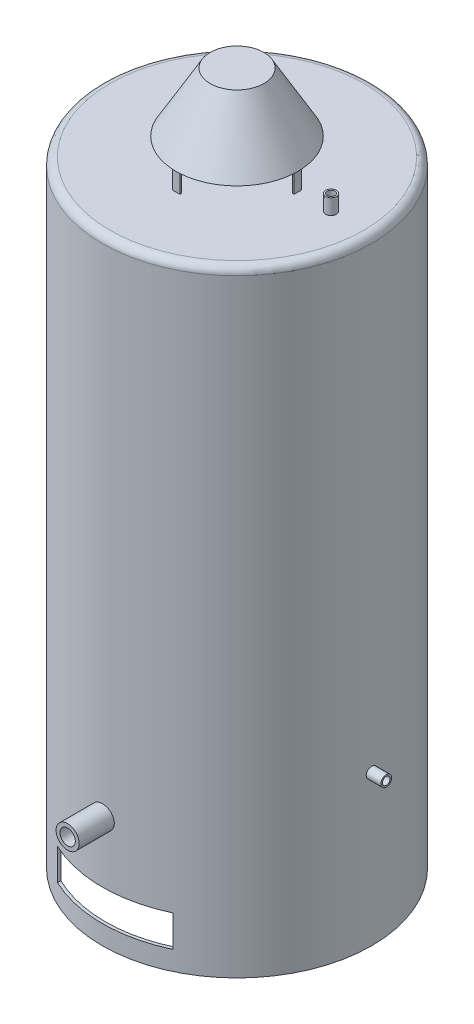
ISO-10303-21;
HEADER;
FILE_DESCRIPTION(('STEP AP214'),'2;1');
FILE_NAME('part.step','',(''),(''),'','','');
FILE_SCHEMA(('AUTOMOTIVE_DESIGN { 1 0 10303 214 1 1 1 1 }'));
ENDSEC;
DATA;
#1=APPLICATION_CONTEXT('core data for automotive mechanical design processes');
#2=APPLICATION_PROTOCOL_DEFINITION('international standard','automotive_design',2000,#1);
#3=PRODUCT_CONTEXT('',#1,'mechanical');
#4=PRODUCT('Part','Part','',(#3));
#5=PRODUCT_RELATED_PRODUCT_CATEGORY('part','',(#4));
#6=PRODUCT_DEFINITION_FORMATION('','',#4);
#7=PRODUCT_DEFINITION_CONTEXT('part definition',#1,'design');
#8=PRODUCT_DEFINITION('design','',#6,#7);
#9=PRODUCT_DEFINITION_SHAPE('','',#8);
#10=(LENGTH_UNIT() NAMED_UNIT(*) SI_UNIT(.MILLI.,.METRE.));
#11=(NAMED_UNIT(*) PLANE_ANGLE_UNIT() SI_UNIT($,.RADIAN.));
#12=(NAMED_UNIT(*) SI_UNIT($,.STERADIAN.) SOLID_ANGLE_UNIT());
#13=UNCERTAINTY_MEASURE_WITH_UNIT(LENGTH_MEASURE(1.E-05),#10,'distance_accuracy_value','');
#14=(GEOMETRIC_REPRESENTATION_CONTEXT(3) GLOBAL_UNCERTAINTY_ASSIGNED_CONTEXT((#13)) GLOBAL_UNIT_ASSIGNED_CONTEXT((#10,
#11,#12)) REPRESENTATION_CONTEXT('',''));
#15=CARTESIAN_POINT('',(0.,0.,0.));
#16=DIRECTION('',(0.,0.,1.));
#17=DIRECTION('',(1.,0.,0.));
#18=AXIS2_PLACEMENT_3D('',#15,#16,#17);
#19=CARTESIAN_POINT('',(-23.8775510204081,578.47476957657,0.));
#20=DIRECTION('',(0.,1.,0.));
#21=DIRECTION('',(-1.,0.,0.));
#22=AXIS2_PLACEMENT_3D('',#19,#20,#21);
#23=CYLINDRICAL_SURFACE('',#22,171.);
#24=CARTESIAN_POINT('',(146.97911405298,-126.465951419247,7.));
#25=CARTESIAN_POINT('',(146.979113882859,-126.269372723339,7.00000149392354));
#26=CARTESIAN_POINT('',(146.979454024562,-126.07281823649,6.99171595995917));
#27=CARTESIAN_POINT('',(146.98080470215,-125.681041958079,6.95863226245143));
#28=CARTESIAN_POINT('',(146.9818154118,-125.485820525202,6.93382981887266));
#29=CARTESIAN_POINT('',(146.984480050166,-125.097995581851,6.8678544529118));
#30=CARTESIAN_POINT('',(146.986134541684,-124.905394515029,6.82666720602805));
#31=CARTESIAN_POINT('',(146.990040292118,-124.524281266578,6.72819928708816));
#32=CARTESIAN_POINT('',(146.992291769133,-124.3357706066,6.67091273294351));
#33=CARTESIAN_POINT('',(146.99732495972,-123.964414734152,6.54071824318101));
#34=CARTESIAN_POINT('',(147.000106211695,-123.781564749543,6.46782389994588));
#35=CARTESIAN_POINT('',(147.006122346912,-123.422590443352,6.30687401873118));
#36=CARTESIAN_POINT('',(147.009357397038,-123.246468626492,6.2188129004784));
#37=CARTESIAN_POINT('',(147.016186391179,-122.902377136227,6.02823314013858));
#38=CARTESIAN_POINT('',(147.019780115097,-122.734402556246,5.9257233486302));
#39=CARTESIAN_POINT('',(147.027227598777,-122.407620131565,5.70689317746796));
#40=CARTESIAN_POINT('',(147.031081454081,-122.248815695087,5.59056771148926));
#41=CARTESIAN_POINT('',(147.038939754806,-121.941526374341,5.34493023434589));
#42=CARTESIAN_POINT('',(147.042944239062,-121.793044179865,5.21561485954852));
#43=CARTESIAN_POINT('',(147.050990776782,-121.507444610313,4.94489021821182));
#44=CARTESIAN_POINT('',(147.055032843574,-121.370331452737,4.80347650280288));
#45=CARTESIAN_POINT('',(147.063037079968,-121.108547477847,4.50964817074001));
#46=CARTESIAN_POINT('',(147.066999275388,-120.983872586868,4.35723718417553));
#47=CARTESIAN_POINT('',(147.074734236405,-120.747755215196,4.04239608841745));
#48=CARTESIAN_POINT('',(147.078506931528,-120.636317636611,3.87996230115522));
#49=CARTESIAN_POINT('',(147.085754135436,-120.427524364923,3.54628385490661));
#50=CARTESIAN_POINT('',(147.089228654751,-120.330168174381,3.37503950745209));
#51=CARTESIAN_POINT('',(147.095782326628,-120.150192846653,3.02489067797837));
#52=CARTESIAN_POINT('',(147.098861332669,-120.067579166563,2.84598338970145));
#53=CARTESIAN_POINT('',(147.10453377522,-119.917749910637,2.48188934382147));
#54=CARTESIAN_POINT('',(147.107127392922,-119.85052858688,2.29670496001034));
#55=CARTESIAN_POINT('',(147.111758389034,-119.731904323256,1.92131029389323));
#56=CARTESIAN_POINT('',(147.113795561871,-119.680507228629,1.73109818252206));
#57=CARTESIAN_POINT('',(147.118974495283,-119.550776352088,1.15529282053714));
#58=CARTESIAN_POINT('',(147.121193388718,-119.496654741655,0.763925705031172));
#59=CARTESIAN_POINT('',(147.122900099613,-119.45491395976,-0.022132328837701));
#60=CARTESIAN_POINT('',(147.122387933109,-119.467294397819,-0.416823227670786));
#61=CARTESIAN_POINT('',(147.118696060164,-119.558089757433,-1.19833567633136));
#62=CARTESIAN_POINT('',(147.115517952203,-119.636465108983,-1.58516179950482));
#63=CARTESIAN_POINT('',(147.106852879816,-119.856987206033,-2.3401467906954));
#64=CARTESIAN_POINT('',(147.101365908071,-119.999134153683,-2.70830559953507));
#65=CARTESIAN_POINT('',(147.088698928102,-120.343203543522,-3.41565141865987));
#66=CARTESIAN_POINT('',(147.081518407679,-120.545144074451,-3.75482962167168));
#67=CARTESIAN_POINT('',(147.066273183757,-121.003056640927,-4.39448482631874));
#68=CARTESIAN_POINT('',(147.058208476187,-121.259028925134,-4.69496164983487));
#69=CARTESIAN_POINT('',(147.042096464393,-121.817962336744,-5.2489167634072));
#70=CARTESIAN_POINT('',(147.034049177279,-122.120957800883,-5.50236041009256));
#71=CARTESIAN_POINT('',(147.01888519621,-122.765215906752,-5.95478769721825));
#72=CARTESIAN_POINT('',(147.011768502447,-123.106478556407,-6.15377132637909));
#73=CARTESIAN_POINT('',(146.999268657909,-123.817604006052,-6.49162686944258));
#74=CARTESIAN_POINT('',(146.993885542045,-124.187467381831,-6.63049757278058));
#75=CARTESIAN_POINT('',(146.985461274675,-124.945286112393,-6.84416250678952));
#76=CARTESIAN_POINT('',(146.982420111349,-125.33324137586,-6.91895706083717));
#77=CARTESIAN_POINT('',(146.979024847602,-126.1159296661,-7.00230389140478));
#78=CARTESIAN_POINT('',(146.978668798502,-126.510657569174,-7.01090420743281));
#79=CARTESIAN_POINT('',(146.98067882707,-127.295951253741,-6.96174369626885));
#80=CARTESIAN_POINT('',(146.983044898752,-127.686517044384,-6.90398301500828));
#81=CARTESIAN_POINT('',(146.990230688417,-128.452265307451,-6.72377996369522));
#82=CARTESIAN_POINT('',(146.995049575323,-128.827452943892,-6.60135950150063));
#83=CARTESIAN_POINT('',(147.006597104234,-129.551953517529,-6.29533403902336));
#84=CARTESIAN_POINT('',(147.013325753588,-129.901266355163,-6.11172880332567));
#85=CARTESIAN_POINT('',(147.027939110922,-130.564322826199,-5.68842247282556));
#86=CARTESIAN_POINT('',(147.035824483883,-130.878045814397,-5.44868906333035));
#87=CARTESIAN_POINT('',(147.051860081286,-131.4608094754,-4.91997746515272));
#88=CARTESIAN_POINT('',(147.060010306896,-131.729849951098,-4.63099905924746));
#89=CARTESIAN_POINT('',(147.075662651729,-132.215772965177,-4.01179968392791));
#90=CARTESIAN_POINT('',(147.083164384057,-132.432624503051,-3.68155437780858));
#91=CARTESIAN_POINT('',(147.096668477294,-132.807800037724,-2.98929965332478));
#92=CARTESIAN_POINT('',(147.102670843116,-132.966124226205,-2.62729033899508));
#93=CARTESIAN_POINT('',(147.112498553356,-133.219704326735,-1.8819726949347));
#94=CARTESIAN_POINT('',(147.116324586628,-133.314980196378,-1.49867114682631));
#95=CARTESIAN_POINT('',(147.121368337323,-133.439795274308,-0.721282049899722));
#96=CARTESIAN_POINT('',(147.122586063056,-133.469334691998,-0.327194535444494));
#97=CARTESIAN_POINT('',(147.12236120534,-133.463789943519,0.262927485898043));
#98=CARTESIAN_POINT('',(147.121944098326,-133.45362671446,0.459500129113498));
#99=CARTESIAN_POINT('',(147.120442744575,-133.41679838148,0.851071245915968));
#100=CARTESIAN_POINT('',(147.119358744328,-133.3901393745,1.04607027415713));
#101=CARTESIAN_POINT('',(147.116552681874,-133.320489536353,1.43318522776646));
#102=CARTESIAN_POINT('',(147.114830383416,-133.277492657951,1.62530005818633));
#103=CARTESIAN_POINT('',(147.110797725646,-133.175497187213,2.00515530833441));
#104=CARTESIAN_POINT('',(147.108487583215,-133.116504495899,2.19289731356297));
#105=CARTESIAN_POINT('',(147.103343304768,-132.98290443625,2.56281328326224));
#106=CARTESIAN_POINT('',(147.100508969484,-132.908291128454,2.74498509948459));
#107=CARTESIAN_POINT('',(147.094398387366,-132.744025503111,3.10232820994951));
#108=CARTESIAN_POINT('',(147.091122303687,-132.6543787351,3.27750205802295));
#109=CARTESIAN_POINT('',(147.084219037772,-132.460631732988,3.61973568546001));
#110=CARTESIAN_POINT('',(147.080591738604,-132.356526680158,3.78679273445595));
#111=CARTESIAN_POINT('',(147.073091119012,-132.134666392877,4.11148614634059));
#112=CARTESIAN_POINT('',(147.06921788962,-132.016916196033,4.26912595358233));
#113=CARTESIAN_POINT('',(147.0613299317,-131.768446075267,4.57408717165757));
#114=CARTESIAN_POINT('',(147.057315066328,-131.63771337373,4.72139816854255));
#115=CARTESIAN_POINT('',(147.049262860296,-131.364354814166,5.00443186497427));
#116=CARTESIAN_POINT('',(147.045225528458,-131.221733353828,5.14015881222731));
#117=CARTESIAN_POINT('',(147.037238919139,-130.92547537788,5.39920252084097));
#118=CARTESIAN_POINT('',(147.033289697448,-130.771832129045,5.52251158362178));
#119=CARTESIAN_POINT('',(147.025595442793,-130.454757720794,5.75570491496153));
#120=CARTESIAN_POINT('',(147.021850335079,-130.291330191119,5.86559411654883));
#121=CARTESIAN_POINT('',(147.014664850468,-129.955598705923,6.07133990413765));
#122=CARTESIAN_POINT('',(147.011224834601,-129.783284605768,6.16717995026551));
#123=CARTESIAN_POINT('',(147.004753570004,-129.431247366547,6.34395793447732));
#124=CARTESIAN_POINT('',(147.001722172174,-129.251526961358,6.42490131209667));
#125=CARTESIAN_POINT('',(146.996155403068,-128.886053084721,6.57128754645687));
#126=CARTESIAN_POINT('',(146.99361959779,-128.700305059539,6.63674397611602));
#127=CARTESIAN_POINT('',(146.98911332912,-128.324011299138,6.75176421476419));
#128=CARTESIAN_POINT('',(146.987142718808,-128.133466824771,6.80133215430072));
#129=CARTESIAN_POINT('',(146.983392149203,-127.699017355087,6.89498900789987));
#130=CARTESIAN_POINT('',(146.981793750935,-127.454073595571,6.93433399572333));
#131=CARTESIAN_POINT('',(146.979654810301,-126.961390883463,6.98683854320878));
#132=CARTESIAN_POINT('',(146.979114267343,-126.713651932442,6.99999811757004));
#133=CARTESIAN_POINT('',(146.97911405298,-126.465951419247,7.));
#134=B_SPLINE_CURVE_WITH_KNOTS('',3,(#24,#25,#26,#27,#28,#29,#30,#31,#32,#33,#34,#35,#36,#37,
#38,#39,#40,#41,#42,#43,#44,#45,#46,#47,#48,#49,#50,#51,#52,#53,#54,#55,#56,#57,#58,#59,#60,#61,
#62,#63,#64,#65,#66,#67,#68,#69,#70,#71,#72,#73,#74,#75,#76,#77,#78,#79,#80,#81,#82,#83,#84,#85,
#86,#87,#88,#89,#90,#91,#92,#93,#94,#95,#96,#97,#98,#99,#100,#101,#102,#103,#104,#105,#106,#107,
#108,#109,#110,#111,#112,#113,#114,#115,#116,#117,#118,#119,#120,#121,#122,#123,#124,#125,#126,
#127,#128,#129,#130,#131,#132,#133),.UNSPECIFIED.,.T.,.F.,(4,2,2,2,2,2,2,2,2,2,2,2,2,2,2,2,2,2,
2,2,2,2,2,2,2,2,2,2,2,2,2,2,2,2,2,2,2,2,2,2,2,2,2,2,2,2,2,2,2,2,2,2,2,2,4),(0.,
0.589519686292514,1.17919219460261,1.76938136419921,2.35978644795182,2.94967944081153,
3.5397899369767,4.12954051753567,4.71950889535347,5.30963043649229,5.89996992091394,
6.49011542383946,7.08047879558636,7.67082130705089,8.26138188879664,8.85172157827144,
9.44227906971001,10.6214572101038,11.8006284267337,12.9790931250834,14.1575615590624,
15.3363868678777,16.5152176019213,17.6949132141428,18.8746090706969,20.0543286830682,
21.2340423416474,22.4128997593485,23.5917545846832,24.7702102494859,25.9486704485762,
27.1278107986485,28.3069563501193,29.4868006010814,30.6666409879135,31.8461077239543,
33.0255707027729,33.6155038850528,34.2052191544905,34.7951529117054,35.3848693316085,
35.9748103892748,36.5645341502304,37.1544549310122,37.7441586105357,38.3344485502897,
38.9245211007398,39.5149572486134,40.1051756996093,40.696083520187,41.286775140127,
41.8769471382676,42.4669655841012,43.2097948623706,43.95262372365),.UNSPECIFIED.);
#135=CARTESIAN_POINT('',(146.97911405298,-126.465951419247,7.));
#136=VERTEX_POINT('',#135);
#137=EDGE_CURVE('E49',#136,#136,#134,.T.);
#138=ORIENTED_EDGE('',*,*,#137,.F.);
#139=EDGE_LOOP('',(#138));
#140=FACE_BOUND('',#139,.T.);
#141=CARTESIAN_POINT('',(-23.8775510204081,464.47476957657,0.));
#142=DIRECTION('',(0.,1.,0.));
#143=DIRECTION('',(-1.,0.,0.));
#144=AXIS2_PLACEMENT_3D('',#141,#142,#143);
#145=CIRCLE('',#144,171.);
#146=CARTESIAN_POINT('',(-194.877551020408,464.47476957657,0.));
#147=VERTEX_POINT('',#146);
#148=EDGE_CURVE('E375',#147,#147,#145,.T.);
#149=ORIENTED_EDGE('',*,*,#148,.T.);
#150=EDGE_LOOP('',(#149));
#151=FACE_BOUND('',#150,.T.);
#152=CARTESIAN_POINT('',(-23.877551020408,-226.465951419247,0.));
#153=DIRECTION('',(0.,1.,0.));
#154=DIRECTION('',(-1.,0.,0.));
#155=AXIS2_PLACEMENT_3D('',#152,#153,#154);
#156=CIRCLE('',#155,171.);
#157=CARTESIAN_POINT('',(-194.877551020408,-226.465951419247,0.));
#158=VERTEX_POINT('',#157);
#159=EDGE_CURVE('E366',#158,#158,#156,.T.);
#160=ORIENTED_EDGE('',*,*,#159,.F.);
#161=EDGE_LOOP('',(#160));
#162=FACE_BOUND('',#161,.T.);
#163=CARTESIAN_POINT('',(-38.877551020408,-176.465951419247,170.340834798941));
#164=CARTESIAN_POINT('',(-38.8775548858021,-176.045394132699,170.340833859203));
#165=CARTESIAN_POINT('',(-38.8598573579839,-175.624896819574,170.342395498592));
#166=CARTESIAN_POINT('',(-38.7891968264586,-174.786762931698,170.348595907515));
#167=CARTESIAN_POINT('',(-38.7362251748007,-174.369127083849,170.353235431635));
#168=CARTESIAN_POINT('',(-38.5953179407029,-173.539416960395,170.36546692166));
#169=CARTESIAN_POINT('',(-38.5073472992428,-173.127348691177,170.373061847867));
#170=CARTESIAN_POINT('',(-38.2970833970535,-172.312124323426,170.390986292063));
#171=CARTESIAN_POINT('',(-38.1747902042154,-171.908968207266,170.401315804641));
#172=CARTESIAN_POINT('',(-37.8968467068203,-171.114662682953,170.424407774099));
#173=CARTESIAN_POINT('',(-37.7412160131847,-170.723506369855,170.437168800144));
#174=CARTESIAN_POINT('',(-37.3976699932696,-169.95570795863,170.46476486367));
#175=CARTESIAN_POINT('',(-37.2097541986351,-169.57906607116,170.479599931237));
#176=CARTESIAN_POINT('',(-36.8030248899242,-168.843033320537,170.51091957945));
#177=CARTESIAN_POINT('',(-36.58421817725,-168.48363868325,170.527403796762));
#178=CARTESIAN_POINT('',(-36.1172274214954,-167.784532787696,170.561558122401));
#179=CARTESIAN_POINT('',(-35.8690434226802,-167.444821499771,170.579228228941));
#180=CARTESIAN_POINT('',(-35.3443882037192,-166.786632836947,170.615300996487));
#181=CARTESIAN_POINT('',(-35.0678474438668,-166.46821098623,170.633705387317));
#182=CARTESIAN_POINT('',(-34.4889500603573,-165.855778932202,170.670683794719));
#183=CARTESIAN_POINT('',(-34.1865933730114,-165.561768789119,170.689257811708));
#184=CARTESIAN_POINT('',(-33.558179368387,-165.000219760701,170.726050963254));
#185=CARTESIAN_POINT('',(-33.2321210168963,-164.732682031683,170.74427008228));
#186=CARTESIAN_POINT('',(-32.5586092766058,-164.225983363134,170.779837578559));
#187=CARTESIAN_POINT('',(-32.2111558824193,-163.986822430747,170.797185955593));
#188=CARTESIAN_POINT('',(-31.4967247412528,-163.538214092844,170.830548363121));
#189=CARTESIAN_POINT('',(-31.1297164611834,-163.328815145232,170.846560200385));
#190=CARTESIAN_POINT('',(-30.3792867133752,-162.941688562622,170.876763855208));
#191=CARTESIAN_POINT('',(-29.9958652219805,-162.763960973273,170.890955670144));
#192=CARTESIAN_POINT('',(-29.2153372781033,-162.441460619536,170.917115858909));
#193=CARTESIAN_POINT('',(-28.8182310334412,-162.296687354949,170.929084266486));
#194=CARTESIAN_POINT('',(-28.0131577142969,-162.04114232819,170.950457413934));
#195=CARTESIAN_POINT('',(-27.6051906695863,-161.930370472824,170.959862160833));
#196=CARTESIAN_POINT('',(-26.7823806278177,-161.743877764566,170.975819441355));
#197=CARTESIAN_POINT('',(-26.3675582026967,-161.668066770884,170.982379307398));
#198=CARTESIAN_POINT('',(-25.532968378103,-161.551625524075,170.992496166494));
#199=CARTESIAN_POINT('',(-25.113200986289,-161.510995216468,170.996053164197));
#200=CARTESIAN_POINT('',(-24.271728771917,-161.46521264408,171.000063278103));
#201=CARTESIAN_POINT('',(-23.8500239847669,-161.460059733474,171.000516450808));
#202=CARTESIAN_POINT('',(-23.0076857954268,-161.485267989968,170.998306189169));
#203=CARTESIAN_POINT('',(-22.5870523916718,-161.51562910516,170.995642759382));
#204=CARTESIAN_POINT('',(-21.7510183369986,-161.611510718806,170.987286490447));
#205=CARTESIAN_POINT('',(-21.3356064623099,-161.676934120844,170.9816020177));
#206=CARTESIAN_POINT('',(-20.5117876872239,-161.842403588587,170.967369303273));
#207=CARTESIAN_POINT('',(-20.1033807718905,-161.94244958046,170.9588210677));
#208=CARTESIAN_POINT('',(-19.2964593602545,-162.17644233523,170.939101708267));
#209=CARTESIAN_POINT('',(-18.8979449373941,-162.310389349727,170.927930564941));
#210=CARTESIAN_POINT('',(-18.1136224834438,-162.611221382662,170.90327992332));
#211=CARTESIAN_POINT('',(-17.7278144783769,-162.778106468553,170.889800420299));
#212=CARTESIAN_POINT('',(-16.9711030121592,-163.14387142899,170.860892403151));
#213=CARTESIAN_POINT('',(-16.6002205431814,-163.34279452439,170.845461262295));
#214=CARTESIAN_POINT('',(-15.876523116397,-163.771057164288,170.813098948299));
#215=CARTESIAN_POINT('',(-15.5237081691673,-164.000396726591,170.796167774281));
#216=CARTESIAN_POINT('',(-14.8386123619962,-164.487873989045,170.761281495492));
#217=CARTESIAN_POINT('',(-14.5063318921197,-164.746012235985,170.743326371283));
#218=CARTESIAN_POINT('',(-13.8646384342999,-165.289265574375,170.706897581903));
#219=CARTESIAN_POINT('',(-13.5552255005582,-165.574380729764,170.688423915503));
#220=CARTESIAN_POINT('',(-12.9604329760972,-166.170591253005,170.651415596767));
#221=CARTESIAN_POINT('',(-12.6751379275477,-166.481770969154,170.6328809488));
#222=CARTESIAN_POINT('',(-12.1317676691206,-167.12708138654,170.596338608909));
#223=CARTESIAN_POINT('',(-11.8736925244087,-167.46121214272,170.578330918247));
#224=CARTESIAN_POINT('',(-11.3865918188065,-168.15006986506,170.543353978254));
#225=CARTESIAN_POINT('',(-11.1575663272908,-168.504796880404,170.526384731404));
#226=CARTESIAN_POINT('',(-10.7301979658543,-169.232342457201,170.493967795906));
#227=CARTESIAN_POINT('',(-10.5318550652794,-169.605161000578,170.478520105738));
#228=CARTESIAN_POINT('',(-10.1672464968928,-170.366308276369,170.449584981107));
#229=CARTESIAN_POINT('',(-10.000985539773,-170.754639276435,170.436097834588));
#230=CARTESIAN_POINT('',(-9.70177661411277,-171.54400315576,170.411472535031));
#231=CARTESIAN_POINT('',(-9.56882866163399,-171.945036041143,170.400334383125));
#232=CARTESIAN_POINT('',(-9.33721320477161,-172.756938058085,170.380726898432));
#233=CARTESIAN_POINT('',(-9.23854504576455,-173.167807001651,170.37225751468));
#234=CARTESIAN_POINT('',(-9.07620601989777,-173.996450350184,170.358230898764));
#235=CARTESIAN_POINT('',(-9.01253505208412,-174.414224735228,170.3526736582));
#236=CARTESIAN_POINT('',(-8.92080961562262,-175.252285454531,170.344644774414));
#237=CARTESIAN_POINT('',(-8.89263723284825,-175.672558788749,170.342162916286));
#238=CARTESIAN_POINT('',(-8.87172538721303,-176.513992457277,170.340322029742));
#239=CARTESIAN_POINT('',(-8.87898584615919,-176.935152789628,170.340962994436));
#240=CARTESIAN_POINT('',(-8.92888632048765,-177.775351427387,170.345349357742));
#241=CARTESIAN_POINT('',(-8.97152598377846,-178.194389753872,170.349094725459));
#242=CARTESIAN_POINT('',(-9.09187351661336,-179.027361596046,170.359582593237));
#243=CARTESIAN_POINT('',(-9.1695813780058,-179.441295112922,170.3663250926));
#244=CARTESIAN_POINT('',(-9.35934776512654,-180.26045397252,170.382601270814));
#245=CARTESIAN_POINT('',(-9.4713509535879,-180.665692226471,170.392130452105));
#246=CARTESIAN_POINT('',(-9.72894190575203,-181.465279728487,170.413712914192));
#247=CARTESIAN_POINT('',(-9.87452962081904,-181.85962899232,170.425766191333));
#248=CARTESIAN_POINT('',(-10.198248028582,-182.634666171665,170.452054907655));
#249=CARTESIAN_POINT('',(-10.376379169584,-183.015353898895,170.466290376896));
#250=CARTESIAN_POINT('',(-10.7639139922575,-183.760390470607,170.496540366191));
#251=CARTESIAN_POINT('',(-10.9733177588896,-184.124739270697,170.512554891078));
#252=CARTESIAN_POINT('',(-11.4225050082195,-184.835480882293,170.54595468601));
#253=CARTESIAN_POINT('',(-11.6623669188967,-185.181823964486,170.563343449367));
#254=CARTESIAN_POINT('',(-12.1703390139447,-185.853088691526,170.598962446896));
#255=CARTESIAN_POINT('',(-12.4384492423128,-186.178010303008,170.61719268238));
#256=CARTESIAN_POINT('',(-13.0010328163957,-186.804156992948,170.65397970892));
#257=CARTESIAN_POINT('',(-13.2955066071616,-187.105381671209,170.672536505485));
#258=CARTESIAN_POINT('',(-13.9087439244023,-187.682012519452,170.709452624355));
#259=CARTESIAN_POINT('',(-14.2275074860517,-187.957418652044,170.727811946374));
#260=CARTESIAN_POINT('',(-14.8879989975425,-188.481195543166,170.7638650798));
#261=CARTESIAN_POINT('',(-15.2297879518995,-188.729489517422,170.781556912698));
#262=CARTESIAN_POINT('',(-15.9331281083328,-189.196399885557,170.815719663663));
#263=CARTESIAN_POINT('',(-16.2946793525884,-189.41501621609,170.832190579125));
#264=CARTESIAN_POINT('',(-17.0349840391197,-189.82100644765,170.863444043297));
#265=CARTESIAN_POINT('',(-17.4137373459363,-190.008380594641,170.878226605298));
#266=CARTESIAN_POINT('',(-18.1857623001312,-190.350540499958,170.90568368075));
#267=CARTESIAN_POINT('',(-18.5790339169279,-190.505326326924,170.918358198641));
#268=CARTESIAN_POINT('',(-19.3767396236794,-190.780997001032,170.941222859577));
#269=CARTESIAN_POINT('',(-19.7811573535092,-190.901928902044,170.951416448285));
#270=CARTESIAN_POINT('',(-20.5988008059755,-191.10930083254,170.969052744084));
#271=CARTESIAN_POINT('',(-21.0120265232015,-191.195740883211,170.976495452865));
#272=CARTESIAN_POINT('',(-21.8443267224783,-191.33349731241,170.988418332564));
#273=CARTESIAN_POINT('',(-22.2634011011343,-191.384814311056,170.992898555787));
#274=CARTESIAN_POINT('',(-23.1044048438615,-191.451951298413,170.998769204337));
#275=CARTESIAN_POINT('',(-23.5263342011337,-191.467771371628,171.000159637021));
#276=CARTESIAN_POINT('',(-24.3686050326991,-191.463805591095,170.999811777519));
#277=CARTESIAN_POINT('',(-24.7889470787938,-191.444139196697,170.998083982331));
#278=CARTESIAN_POINT('',(-25.6264699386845,-191.369576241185,170.991568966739));
#279=CARTESIAN_POINT('',(-26.0436507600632,-191.314679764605,170.986781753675));
#280=CARTESIAN_POINT('',(-26.871885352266,-191.170055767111,170.974283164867));
#281=CARTESIAN_POINT('',(-27.2829391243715,-191.080328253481,170.966571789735));
#282=CARTESIAN_POINT('',(-28.096004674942,-190.8666919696,170.948442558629));
#283=CARTESIAN_POINT('',(-28.4980164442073,-190.742783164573,170.938024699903));
#284=CARTESIAN_POINT('',(-29.2901240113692,-190.461688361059,170.914777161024));
#285=CARTESIAN_POINT('',(-29.6802207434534,-190.304504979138,170.90194767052));
#286=CARTESIAN_POINT('',(-30.4457832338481,-189.957981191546,170.874237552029));
#287=CARTESIAN_POINT('',(-30.8212489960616,-189.768640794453,170.859356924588));
#288=CARTESIAN_POINT('',(-31.5549074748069,-189.359154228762,170.827963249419));
#289=CARTESIAN_POINT('',(-31.9131004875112,-189.139008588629,170.811450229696));
#290=CARTESIAN_POINT('',(-32.6097128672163,-188.669466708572,170.777255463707));
#291=CARTESIAN_POINT('',(-32.948132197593,-188.420070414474,170.759573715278));
#292=CARTESIAN_POINT('',(-33.6038844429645,-187.892935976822,170.723480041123));
#293=CARTESIAN_POINT('',(-33.9211460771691,-187.615109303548,170.705065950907));
#294=CARTESIAN_POINT('',(-34.5311567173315,-187.033742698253,170.668081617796));
#295=CARTESIAN_POINT('',(-34.823905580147,-186.730202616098,170.649511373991));
#296=CARTESIAN_POINT('',(-35.3828958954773,-186.099468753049,170.612735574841));
#297=CARTESIAN_POINT('',(-35.6491307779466,-185.772269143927,170.594530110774));
#298=CARTESIAN_POINT('',(-36.1531245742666,-185.096590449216,170.559004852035));
#299=CARTESIAN_POINT('',(-36.3908839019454,-184.748111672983,170.541685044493));
#300=CARTESIAN_POINT('',(-36.8366990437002,-184.031589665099,170.508388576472));
#301=CARTESIAN_POINT('',(-37.0446930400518,-183.663507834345,170.492414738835));
#302=CARTESIAN_POINT('',(-37.4289056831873,-182.911046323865,170.462306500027));
#303=CARTESIAN_POINT('',(-37.6051242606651,-182.526666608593,170.448172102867));
#304=CARTESIAN_POINT('',(-37.9243516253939,-181.744731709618,170.422161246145));
#305=CARTESIAN_POINT('',(-38.0673942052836,-181.347190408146,170.41028249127));
#306=CARTESIAN_POINT('',(-38.3194281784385,-180.541530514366,170.389108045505));
#307=CARTESIAN_POINT('',(-38.4284280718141,-180.133414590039,170.379811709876));
#308=CARTESIAN_POINT('',(-38.6387005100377,-179.187586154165,170.361741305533));
#309=CARTESIAN_POINT('',(-38.7281857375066,-178.647192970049,170.353932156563));
#310=CARTESIAN_POINT('',(-38.8476083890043,-177.55981651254,170.34347952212));
#311=CARTESIAN_POINT('',(-38.8775459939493,-177.012833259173,170.340836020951));
#312=CARTESIAN_POINT('',(-38.877551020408,-176.465951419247,170.340834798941));
#313=B_SPLINE_CURVE_WITH_KNOTS('',3,(#163,#164,#165,#166,#167,#168,#169,#170,#171,#172,#173,
#174,#175,#176,#177,#178,#179,#180,#181,#182,#183,#184,#185,#186,#187,#188,#189,#190,#191,#192,
#193,#194,#195,#196,#197,#198,#199,#200,#201,#202,#203,#204,#205,#206,#207,#208,#209,#210,#211,
#212,#213,#214,#215,#216,#217,#218,#219,#220,#221,#222,#223,#224,#225,#226,#227,#228,#229,#230,
#231,#232,#233,#234,#235,#236,#237,#238,#239,#240,#241,#242,#243,#244,#245,#246,#247,#248,#249,
#250,#251,#252,#253,#254,#255,#256,#257,#258,#259,#260,#261,#262,#263,#264,#265,#266,#267,#268,
#269,#270,#271,#272,#273,#274,#275,#276,#277,#278,#279,#280,#281,#282,#283,#284,#285,#286,#287,
#288,#289,#290,#291,#292,#293,#294,#295,#296,#297,#298,#299,#300,#301,#302,#303,#304,#305,#306,
#307,#308,#309,#310,#311,#312),.UNSPECIFIED.,.T.,.F.,(4,2,2,2,2,2,2,2,2,2,2,2,2,2,2,2,2,2,2,2,2,
2,2,2,2,2,2,2,2,2,2,2,2,2,2,2,2,2,2,2,2,2,2,2,2,2,2,2,2,2,2,2,2,2,2,2,2,2,2,2,2,2,2,2,2,2,2,2,2,
2,2,2,2,2,4),(0.,1.26119372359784,2.52269676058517,3.78546665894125,5.04823405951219,
6.31026066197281,7.57230557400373,8.83407304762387,10.0958386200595,11.3607760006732,
12.6257165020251,13.89071223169,15.1557082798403,16.4227409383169,17.6897754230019,
18.9567906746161,20.2238024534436,21.4875289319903,22.7512534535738,24.0149549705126,
25.278654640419,26.5388727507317,27.7990881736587,29.059312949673,30.3195403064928,
31.5814822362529,32.8434249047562,34.1053915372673,35.3673611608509,36.6335853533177,
37.8998125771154,39.1660428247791,40.4322718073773,41.698686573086,42.9651019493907,
44.2314931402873,45.4978806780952,46.7600505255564,48.0222175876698,49.2843720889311,
50.5465262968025,51.8066545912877,53.0667810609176,54.3269248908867,55.5870721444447,
56.8505326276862,58.1139950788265,59.377478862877,60.6409644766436,61.9079403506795,
63.1749189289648,64.4418875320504,65.7088534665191,66.9740495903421,68.2392449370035,
69.5044179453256,70.7695879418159,72.0305068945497,73.2914228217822,74.5523384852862,
75.8132554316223,77.0740732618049,78.3348907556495,79.5956866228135,80.8564848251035,
82.1213359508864,83.3861944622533,84.6513656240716,85.9165183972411,87.1842616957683,
88.4520077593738,89.7184567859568,90.9845893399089,92.6246180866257,94.2646418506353),.UNSPECIFIED.);
#314=CARTESIAN_POINT('',(-38.877551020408,-176.465951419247,170.340834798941));
#315=VERTEX_POINT('',#314);
#316=EDGE_CURVE('E11',#315,#315,#313,.T.);
#317=ORIENTED_EDGE('',*,*,#316,.F.);
#318=EDGE_LOOP('',(#317));
#319=FACE_BOUND('',#318,.T.);
#320=ADVANCED_FACE('F37',(#140,#151,#162,#319),#23,.F.);
#321=CARTESIAN_POINT('',(0.,474.47476957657,0.));
#322=DIRECTION('',(0.,1.,0.));
#323=DIRECTION('',(-1.,0.,0.));
#324=AXIS2_PLACEMENT_3D('',#321,#322,#323);
#325=PLANE('',#324);
#326=CARTESIAN_POINT('',(98.2517462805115,474.47476957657,0.));
#327=DIRECTION('',(0.,1.,0.));
#328=DIRECTION('',(-1.,0.,0.));
#329=AXIS2_PLACEMENT_3D('',#326,#327,#328);
#330=CIRCLE('',#329,5.);
#331=CARTESIAN_POINT('',(93.2517462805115,474.47476957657,0.));
#332=VERTEX_POINT('',#331);
#333=EDGE_CURVE('E509',#332,#332,#330,.F.);
#334=ORIENTED_EDGE('',*,*,#333,.F.);
#335=EDGE_LOOP('',(#334));
#336=FACE_BOUND('',#335,.T.);
#337=CARTESIAN_POINT('',(-23.8775510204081,474.47476957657,0.));
#338=DIRECTION('',(0.,1.,0.));
#339=DIRECTION('',(-1.,0.,0.));
#340=AXIS2_PLACEMENT_3D('',#337,#338,#339);
#341=CIRCLE('',#340,161.);
#342=CARTESIAN_POINT('',(-184.877551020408,474.47476957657,0.));
#343=VERTEX_POINT('',#342);
#344=EDGE_CURVE('E378',#343,#343,#341,.F.);
#345=ORIENTED_EDGE('',*,*,#344,.T.);
#346=EDGE_LOOP('',(#345));
#347=FACE_BOUND('',#346,.T.);
#348=CARTESIAN_POINT('',(-23.8775510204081,474.47476957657,0.));
#349=DIRECTION('',(0.,1.,0.));
#350=DIRECTION('',(-1.,0.,0.));
#351=AXIS2_PLACEMENT_3D('',#348,#349,#350);
#352=CIRCLE('',#351,39.0000000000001);
#353=CARTESIAN_POINT('',(-62.8775510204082,474.47476957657,0.));
#354=VERTEX_POINT('',#353);
#355=EDGE_CURVE('E360',#354,#354,#352,.T.);
#356=ORIENTED_EDGE('',*,*,#355,.T.);
#357=EDGE_LOOP('',(#356));
#358=FACE_BOUND('',#357,.T.);
#359=ADVANCED_FACE('F478',(#336,#347,#358),#325,.F.);
#360=CARTESIAN_POINT('',(0.,-226.465951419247,0.));
#361=DIRECTION('',(0.,1.,0.));
#362=DIRECTION('',(-1.,0.,0.));
#363=AXIS2_PLACEMENT_3D('',#360,#361,#362);
#364=PLANE('',#363);
#365=ORIENTED_EDGE('',*,*,#159,.T.);
#366=EDGE_LOOP('',(#365));
#367=FACE_BOUND('',#366,.T.);
#368=CARTESIAN_POINT('',(-23.877551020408,-226.465951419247,0.));
#369=DIRECTION('',(0.,1.,0.));
#370=DIRECTION('',(-1.,0.,0.));
#371=AXIS2_PLACEMENT_3D('',#368,#369,#370);
#372=CIRCLE('',#371,39.0000000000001);
#373=CARTESIAN_POINT('',(-62.8775510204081,-226.465951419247,0.));
#374=VERTEX_POINT('',#373);
#375=EDGE_CURVE('E363',#374,#374,#372,.T.);
#376=ORIENTED_EDGE('',*,*,#375,.F.);
#377=EDGE_LOOP('',(#376));
#378=FACE_BOUND('',#377,.T.);
#379=ADVANCED_FACE('F483',(#367,#378),#364,.T.);
#380=CARTESIAN_POINT('',(-23.8775510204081,578.47476957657,0.));
#381=DIRECTION('',(0.,1.,0.));
#382=DIRECTION('',(-1.,0.,0.));
#383=AXIS2_PLACEMENT_3D('',#380,#381,#382);
#384=CYLINDRICAL_SURFACE('',#383,39.0000000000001);
#385=ORIENTED_EDGE('',*,*,#375,.T.);
#386=EDGE_LOOP('',(#385));
#387=FACE_BOUND('',#386,.T.);
#388=ORIENTED_EDGE('',*,*,#355,.F.);
#389=EDGE_LOOP('',(#388));
#390=FACE_BOUND('',#389,.T.);
#391=ADVANCED_FACE('F520',(#387,#390),#384,.T.);
#392=CARTESIAN_POINT('',(-23.8775510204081,464.47476957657,0.));
#393=DIRECTION('',(0.,1.,0.));
#394=DIRECTION('',(-1.,0.,0.));
#395=AXIS2_PLACEMENT_3D('',#392,#393,#394);
#396=TOROIDAL_SURFACE('',#395,161.,10.);
#397=ORIENTED_EDGE('',*,*,#344,.F.);
#398=EDGE_LOOP('',(#397));
#399=FACE_BOUND('',#398,.T.);
#400=ORIENTED_EDGE('',*,*,#148,.F.);
#401=EDGE_LOOP('',(#400));
#402=FACE_BOUND('',#401,.T.);
#403=ADVANCED_FACE('F39',(#399,#402),#396,.F.);
#404=CARTESIAN_POINT('',(170.,-126.465951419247,0.));
#405=DIRECTION('',(-1.,0.,0.));
#406=DIRECTION('',(0.,0.,1.));
#407=AXIS2_PLACEMENT_3D('',#404,#405,#406);
#408=CYLINDRICAL_SURFACE('',#407,7.);
#409=CARTESIAN_POINT('',(140.,-126.465951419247,0.));
#410=DIRECTION('',(1.,0.,0.));
#411=DIRECTION('',(0.,0.,-1.));
#412=AXIS2_PLACEMENT_3D('',#409,#410,#411);
#413=CIRCLE('',#412,7.);
#414=CARTESIAN_POINT('',(140.,-126.465951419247,-7.));
#415=VERTEX_POINT('',#414);
#416=EDGE_CURVE('E427',#415,#415,#413,.T.);
#417=ORIENTED_EDGE('',*,*,#416,.T.);
#418=EDGE_LOOP('',(#417));
#419=FACE_BOUND('',#418,.T.);
#420=ORIENTED_EDGE('',*,*,#137,.T.);
#421=EDGE_LOOP('',(#420));
#422=FACE_BOUND('',#421,.T.);
#423=ADVANCED_FACE('F411',(#419,#422),#408,.T.);
#424=CARTESIAN_POINT('',(140.,-126.465951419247,0.));
#425=DIRECTION('',(1.,0.,0.));
#426=DIRECTION('',(0.,0.,-1.));
#427=AXIS2_PLACEMENT_3D('',#424,#425,#426);
#428=PLANE('',#427);
#429=ORIENTED_EDGE('',*,*,#416,.F.);
#430=EDGE_LOOP('',(#429));
#431=FACE_BOUND('',#430,.T.);
#432=CARTESIAN_POINT('',(140.,-126.465951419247,0.));
#433=DIRECTION('',(1.,0.,0.));
#434=DIRECTION('',(0.,0.,-1.));
#435=AXIS2_PLACEMENT_3D('',#432,#433,#434);
#436=CIRCLE('',#435,5.);
#437=CARTESIAN_POINT('',(140.,-126.465951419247,-5.));
#438=VERTEX_POINT('',#437);
#439=EDGE_CURVE('E449',#438,#438,#436,.T.);
#440=ORIENTED_EDGE('',*,*,#439,.T.);
#441=EDGE_LOOP('',(#440));
#442=FACE_BOUND('',#441,.T.);
#443=ADVANCED_FACE('F412',(#431,#442),#428,.F.);
#444=CARTESIAN_POINT('',(170.,-126.465951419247,0.));
#445=DIRECTION('',(-1.,0.,0.));
#446=DIRECTION('',(0.,0.,1.));
#447=AXIS2_PLACEMENT_3D('',#444,#445,#446);
#448=CYLINDRICAL_SURFACE('',#447,5.);
#449=ORIENTED_EDGE('',*,*,#439,.F.);
#450=EDGE_LOOP('',(#449));
#451=FACE_BOUND('',#450,.T.);
#452=CARTESIAN_POINT('',(170.,-126.465951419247,0.));
#453=DIRECTION('',(1.,0.,0.));
#454=DIRECTION('',(0.,0.,-1.));
#455=AXIS2_PLACEMENT_3D('',#452,#453,#454);
#456=CIRCLE('',#455,5.);
#457=CARTESIAN_POINT('',(170.,-126.465951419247,-5.));
#458=VERTEX_POINT('',#457);
#459=EDGE_CURVE('E453',#458,#458,#456,.T.);
#460=ORIENTED_EDGE('',*,*,#459,.T.);
#461=EDGE_LOOP('',(#460));
#462=FACE_BOUND('',#461,.T.);
#463=ADVANCED_FACE('F464',(#451,#462),#448,.F.);
#464=CARTESIAN_POINT('',(-23.877551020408,-176.465951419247,220.));
#465=DIRECTION('',(0.,0.,-1.));
#466=DIRECTION('',(-1.,0.,0.));
#467=AXIS2_PLACEMENT_3D('',#464,#465,#466);
#468=CYLINDRICAL_SURFACE('',#467,15.);
#469=CARTESIAN_POINT('',(-23.877551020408,-176.465951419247,140.));
#470=DIRECTION('',(0.,0.,1.));
#471=DIRECTION('',(1.,0.,0.));
#472=AXIS2_PLACEMENT_3D('',#469,#470,#471);
#473=CIRCLE('',#472,15.);
#474=CARTESIAN_POINT('',(-8.87755102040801,-176.465951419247,140.));
#475=VERTEX_POINT('',#474);
#476=EDGE_CURVE('E451',#475,#475,#473,.T.);
#477=ORIENTED_EDGE('',*,*,#476,.T.);
#478=EDGE_LOOP('',(#477));
#479=FACE_BOUND('',#478,.T.);
#480=ORIENTED_EDGE('',*,*,#316,.T.);
#481=EDGE_LOOP('',(#480));
#482=FACE_BOUND('',#481,.T.);
#483=ADVANCED_FACE('F461',(#479,#482),#468,.T.);
#484=CARTESIAN_POINT('',(-23.877551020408,-176.465951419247,140.));
#485=DIRECTION('',(0.,0.,1.));
#486=DIRECTION('',(1.,0.,0.));
#487=AXIS2_PLACEMENT_3D('',#484,#485,#486);
#488=PLANE('',#487);
#489=ORIENTED_EDGE('',*,*,#476,.F.);
#490=EDGE_LOOP('',(#489));
#491=FACE_BOUND('',#490,.T.);
#492=CARTESIAN_POINT('',(-23.877551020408,-176.465951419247,140.));
#493=DIRECTION('',(0.,0.,1.));
#494=DIRECTION('',(1.,0.,0.));
#495=AXIS2_PLACEMENT_3D('',#492,#493,#494);
#496=CIRCLE('',#495,10.);
#497=CARTESIAN_POINT('',(-13.877551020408,-176.465951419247,140.));
#498=VERTEX_POINT('',#497);
#499=EDGE_CURVE('E504',#498,#498,#496,.T.);
#500=ORIENTED_EDGE('',*,*,#499,.T.);
#501=EDGE_LOOP('',(#500));
#502=FACE_BOUND('',#501,.T.);
#503=ADVANCED_FACE('F462',(#491,#502),#488,.F.);
#504=CARTESIAN_POINT('',(-23.877551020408,-176.465951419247,220.));
#505=DIRECTION('',(0.,0.,-1.));
#506=DIRECTION('',(-1.,0.,0.));
#507=AXIS2_PLACEMENT_3D('',#504,#505,#506);
#508=CYLINDRICAL_SURFACE('',#507,10.);
#509=ORIENTED_EDGE('',*,*,#499,.F.);
#510=EDGE_LOOP('',(#509));
#511=FACE_BOUND('',#510,.T.);
#512=CARTESIAN_POINT('',(-23.877551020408,-176.465951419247,220.));
#513=DIRECTION('',(0.,0.,1.));
#514=DIRECTION('',(1.,0.,0.));
#515=AXIS2_PLACEMENT_3D('',#512,#513,#514);
#516=CIRCLE('',#515,10.);
#517=CARTESIAN_POINT('',(-13.877551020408,-176.465951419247,220.));
#518=VERTEX_POINT('',#517);
#519=EDGE_CURVE('E501',#518,#518,#516,.T.);
#520=ORIENTED_EDGE('',*,*,#519,.T.);
#521=EDGE_LOOP('',(#520));
#522=FACE_BOUND('',#521,.T.);
#523=ADVANCED_FACE('F435',(#511,#522),#508,.F.);
#524=CARTESIAN_POINT('',(-23.8775510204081,578.47476957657,0.));
#525=DIRECTION('',(0.,1.,0.));
#526=DIRECTION('',(-1.,0.,0.));
#527=AXIS2_PLACEMENT_3D('',#524,#525,#526);
#528=CYLINDRICAL_SURFACE('',#527,175.);
#529=CARTESIAN_POINT('',(-198.591603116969,-275.947261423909,-10.));
#530=CARTESIAN_POINT('',(-198.591602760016,-275.666554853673,-10.0000022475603));
#531=CARTESIAN_POINT('',(-198.592281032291,-275.385884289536,-9.9881758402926));
#532=CARTESIAN_POINT('',(-198.594974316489,-274.826447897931,-9.94095446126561));
#533=CARTESIAN_POINT('',(-198.596989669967,-274.547682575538,-9.90555346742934));
#534=CARTESIAN_POINT('',(-198.602303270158,-273.993848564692,-9.81137952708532));
#535=CARTESIAN_POINT('',(-198.605602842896,-273.718784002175,-9.75258242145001));
#536=CARTESIAN_POINT('',(-198.613390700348,-273.174592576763,-9.61203830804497));
#537=CARTESIAN_POINT('',(-198.617879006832,-272.905465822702,-9.53029087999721));
#538=CARTESIAN_POINT('',(-198.627913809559,-272.375212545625,-9.34448226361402));
#539=CARTESIAN_POINT('',(-198.633459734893,-272.114081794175,-9.24043311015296));
#540=CARTESIAN_POINT('',(-198.645453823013,-271.601515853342,-9.01073623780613));
#541=CARTESIAN_POINT('',(-198.651901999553,-271.350080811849,-8.88508818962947));
#542=CARTESIAN_POINT('',(-198.665515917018,-270.858747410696,-8.61312085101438));
#543=CARTESIAN_POINT('',(-198.672681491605,-270.618846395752,-8.46680634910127));
#544=CARTESIAN_POINT('',(-198.687528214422,-270.152219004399,-8.15452616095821));
#545=CARTESIAN_POINT('',(-198.695209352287,-269.925492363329,-7.98856086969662));
#546=CARTESIAN_POINT('',(-198.710878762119,-269.48656028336,-7.63795306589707));
#547=CARTESIAN_POINT('',(-198.718867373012,-269.27437162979,-7.45328955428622));
#548=CARTESIAN_POINT('',(-198.734916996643,-268.866300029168,-7.06675099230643));
#549=CARTESIAN_POINT('',(-198.742978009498,-268.670417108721,-6.86487591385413));
#550=CARTESIAN_POINT('',(-198.758944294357,-268.296336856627,-6.4453350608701));
#551=CARTESIAN_POINT('',(-198.766849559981,-268.118140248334,-6.22766864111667));
#552=CARTESIAN_POINT('',(-198.782279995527,-267.780705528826,-5.77809310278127));
#553=CARTESIAN_POINT('',(-198.789805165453,-267.621467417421,-5.54618398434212));
#554=CARTESIAN_POINT('',(-198.804266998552,-267.322981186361,-5.06960534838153));
#555=CARTESIAN_POINT('',(-198.811203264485,-267.183746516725,-4.82492739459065));
#556=CARTESIAN_POINT('',(-198.824284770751,-266.926387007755,-4.32468988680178));
#557=CARTESIAN_POINT('',(-198.830430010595,-266.808262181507,-4.06913032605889));
#558=CARTESIAN_POINT('',(-198.841754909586,-266.593967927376,-3.54894746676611));
#559=CARTESIAN_POINT('',(-198.846934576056,-266.497798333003,-3.28432423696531));
#560=CARTESIAN_POINT('',(-198.856181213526,-266.328102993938,-2.74789536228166));
#561=CARTESIAN_POINT('',(-198.860248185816,-266.254577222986,-2.47608972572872));
#562=CARTESIAN_POINT('',(-198.867150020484,-266.130766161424,-1.9275356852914));
#563=CARTESIAN_POINT('',(-198.869986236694,-266.080455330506,-1.65079306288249));
#564=CARTESIAN_POINT('',(-198.874352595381,-266.003316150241,-1.09404395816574));
#565=CARTESIAN_POINT('',(-198.87588273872,-265.976487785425,-0.814037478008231));
#566=CARTESIAN_POINT('',(-198.877593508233,-265.946506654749,-0.252758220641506));
#567=CARTESIAN_POINT('',(-198.877774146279,-265.943353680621,0.0285145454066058));
#568=CARTESIAN_POINT('',(-198.876780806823,-265.96074548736,0.590323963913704));
#569=CARTESIAN_POINT('',(-198.87560683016,-265.981290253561,0.870860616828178));
#570=CARTESIAN_POINT('',(-198.871939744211,-266.045891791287,1.42887187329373));
#571=CARTESIAN_POINT('',(-198.869448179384,-266.089921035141,1.706349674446));
#572=CARTESIAN_POINT('',(-198.863217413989,-266.201158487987,2.25660500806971));
#573=CARTESIAN_POINT('',(-198.859478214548,-266.268366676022,2.52938254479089));
#574=CARTESIAN_POINT('',(-198.85085798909,-266.425481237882,3.06830287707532));
#575=CARTESIAN_POINT('',(-198.845976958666,-266.515387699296,3.33444564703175));
#576=CARTESIAN_POINT('',(-198.835211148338,-266.717256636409,3.85820966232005));
#577=CARTESIAN_POINT('',(-198.82932636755,-266.829219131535,4.11583090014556));
#578=CARTESIAN_POINT('',(-198.816715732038,-267.074474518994,4.62087699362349));
#579=CARTESIAN_POINT('',(-198.809989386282,-267.207779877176,4.86829578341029));
#580=CARTESIAN_POINT('',(-198.795888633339,-267.494725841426,5.35102645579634));
#581=CARTESIAN_POINT('',(-198.788514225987,-267.648366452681,5.58633833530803));
#582=CARTESIAN_POINT('',(-198.773325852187,-267.974894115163,6.0431940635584));
#583=CARTESIAN_POINT('',(-198.765511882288,-268.147781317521,6.26473780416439));
#584=CARTESIAN_POINT('',(-198.749665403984,-268.511577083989,6.69249046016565));
#585=CARTESIAN_POINT('',(-198.741632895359,-268.702485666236,6.89869936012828));
#586=CARTESIAN_POINT('',(-198.725565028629,-269.101259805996,7.29460867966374));
#587=CARTESIAN_POINT('',(-198.717529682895,-269.309149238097,7.48428505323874));
#588=CARTESIAN_POINT('',(-198.701695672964,-269.740174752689,7.84545291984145));
#589=CARTESIAN_POINT('',(-198.693897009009,-269.963310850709,8.01694439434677));
#590=CARTESIAN_POINT('',(-198.67875780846,-270.423249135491,8.34052456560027));
#591=CARTESIAN_POINT('',(-198.671417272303,-270.660051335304,8.49261324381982));
#592=CARTESIAN_POINT('',(-198.65740297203,-271.145643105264,8.7763051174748));
#593=CARTESIAN_POINT('',(-198.650729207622,-271.394432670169,8.90790832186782));
#594=CARTESIAN_POINT('',(-198.638238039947,-271.902245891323,9.14969599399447));
#595=CARTESIAN_POINT('',(-198.632420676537,-272.161270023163,9.25987946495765));
#596=CARTESIAN_POINT('',(-198.621808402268,-272.687701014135,9.45803173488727));
#597=CARTESIAN_POINT('',(-198.617013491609,-272.955107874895,9.54600052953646));
#598=CARTESIAN_POINT('',(-198.608582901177,-273.496399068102,9.69909177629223));
#599=CARTESIAN_POINT('',(-198.604947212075,-273.770283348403,9.76421441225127));
#600=CARTESIAN_POINT('',(-198.598938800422,-274.322579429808,9.87114605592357));
#601=CARTESIAN_POINT('',(-198.59656607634,-274.600991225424,9.91295509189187));
#602=CARTESIAN_POINT('',(-198.593153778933,-275.159960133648,9.97291609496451));
#603=CARTESIAN_POINT('',(-198.592112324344,-275.440513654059,9.99110144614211));
#604=CARTESIAN_POINT('',(-198.591386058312,-276.002157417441,10.0037936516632));
#605=CARTESIAN_POINT('',(-198.591701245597,-276.283247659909,9.99830052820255));
#606=CARTESIAN_POINT('',(-198.593679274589,-276.843962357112,9.96367538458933));
#607=CARTESIAN_POINT('',(-198.595342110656,-277.123586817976,9.93454346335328));
#608=CARTESIAN_POINT('',(-198.5999680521,-277.679381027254,9.85285019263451));
#609=CARTESIAN_POINT('',(-198.602931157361,-277.955550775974,9.80028884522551));
#610=CARTESIAN_POINT('',(-198.610070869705,-278.502289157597,9.67215674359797));
#611=CARTESIAN_POINT('',(-198.614246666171,-278.772861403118,9.59660135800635));
#612=CARTESIAN_POINT('',(-198.623693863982,-279.306675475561,9.42300961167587));
#613=CARTESIAN_POINT('',(-198.628965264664,-279.56991730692,9.32497326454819));
#614=CARTESIAN_POINT('',(-198.640454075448,-280.087207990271,9.10711840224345));
#615=CARTESIAN_POINT('',(-198.646671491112,-280.341256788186,8.98729975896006));
#616=CARTESIAN_POINT('',(-198.65987602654,-280.838363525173,8.72673323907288));
#617=CARTESIAN_POINT('',(-198.666863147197,-281.081421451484,8.58598533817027));
#618=CARTESIAN_POINT('',(-198.681417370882,-281.555095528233,8.28438994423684));
#619=CARTESIAN_POINT('',(-198.688985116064,-281.7856974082,8.12352006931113));
#620=CARTESIAN_POINT('',(-198.70447910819,-282.232534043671,7.78294684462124));
#621=CARTESIAN_POINT('',(-198.712405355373,-282.448768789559,7.60324348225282));
#622=CARTESIAN_POINT('',(-198.72839182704,-282.865343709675,7.22627483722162));
#623=CARTESIAN_POINT('',(-198.736452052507,-283.065683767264,7.02900942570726));
#624=CARTESIAN_POINT('',(-198.752478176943,-283.449050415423,6.61831340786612));
#625=CARTESIAN_POINT('',(-198.760444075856,-283.632076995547,6.40488279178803));
#626=CARTESIAN_POINT('',(-198.776065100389,-283.979722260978,5.9631090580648));
#627=CARTESIAN_POINT('',(-198.783719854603,-284.144319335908,5.73474892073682));
#628=CARTESIAN_POINT('',(-198.798491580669,-284.453690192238,5.26495710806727));
#629=CARTESIAN_POINT('',(-198.805608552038,-284.59846395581,5.02352542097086));
#630=CARTESIAN_POINT('',(-198.819102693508,-284.867155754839,4.52930426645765));
#631=CARTESIAN_POINT('',(-198.825479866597,-284.991073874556,4.27651484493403));
#632=CARTESIAN_POINT('',(-198.83731337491,-285.217169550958,3.76137285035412));
#633=CARTESIAN_POINT('',(-198.842769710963,-285.319347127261,3.499020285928));
#634=CARTESIAN_POINT('',(-198.852603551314,-285.501174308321,2.96678032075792));
#635=CARTESIAN_POINT('',(-198.856981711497,-285.580837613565,2.69689761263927));
#636=CARTESIAN_POINT('',(-198.864539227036,-285.71714771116,2.15136433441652));
#637=CARTESIAN_POINT('',(-198.867718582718,-285.773794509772,1.8757137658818));
#638=CARTESIAN_POINT('',(-198.872788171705,-285.86366410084,1.32061028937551));
#639=CARTESIAN_POINT('',(-198.874678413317,-285.896887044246,1.041157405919));
#640=CARTESIAN_POINT('',(-198.877116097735,-285.939670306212,0.480440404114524));
#641=CARTESIAN_POINT('',(-198.877663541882,-285.949230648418,0.199176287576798));
#642=CARTESIAN_POINT('',(-198.877400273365,-285.944623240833,-0.362755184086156));
#643=CARTESIAN_POINT('',(-198.876591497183,-285.930489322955,-0.6434228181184));
#644=CARTESIAN_POINT('',(-198.873642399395,-285.878659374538,-1.20256669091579));
#645=CARTESIAN_POINT('',(-198.871502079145,-285.84096336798,-1.48104293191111));
#646=CARTESIAN_POINT('',(-198.865950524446,-285.742279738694,-2.0338247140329));
#647=CARTESIAN_POINT('',(-198.86253928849,-285.681292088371,-2.30813025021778));
#648=CARTESIAN_POINT('',(-198.854542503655,-285.536462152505,-2.85062236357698));
#649=CARTESIAN_POINT('',(-198.849956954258,-285.452619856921,-3.11880893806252));
#650=CARTESIAN_POINT('',(-198.839741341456,-285.262680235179,-3.64716060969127));
#651=CARTESIAN_POINT('',(-198.834111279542,-285.156582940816,-3.90732571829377));
#652=CARTESIAN_POINT('',(-198.821965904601,-284.922889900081,-4.41779252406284));
#653=CARTESIAN_POINT('',(-198.815450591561,-284.795294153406,-4.66809422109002));
#654=CARTESIAN_POINT('',(-198.801719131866,-284.519515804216,-5.15705702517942));
#655=CARTESIAN_POINT('',(-198.794503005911,-284.371333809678,-5.3957184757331));
#656=CARTESIAN_POINT('',(-198.779573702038,-284.055431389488,-5.85972300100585));
#657=CARTESIAN_POINT('',(-198.771860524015,-283.887710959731,-6.08506607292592));
#658=CARTESIAN_POINT('',(-198.75614481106,-283.533687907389,-6.52112769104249));
#659=CARTESIAN_POINT('',(-198.748141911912,-283.347361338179,-6.73182678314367));
#660=CARTESIAN_POINT('',(-198.732082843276,-282.957624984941,-7.13679039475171));
#661=CARTESIAN_POINT('',(-198.724026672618,-282.754214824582,-7.33105455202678));
#662=CARTESIAN_POINT('',(-198.708087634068,-282.331703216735,-7.70181253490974));
#663=CARTESIAN_POINT('',(-198.700204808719,-282.112597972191,-7.87830203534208));
#664=CARTESIAN_POINT('',(-198.684838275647,-281.660294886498,-8.21220217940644));
#665=CARTESIAN_POINT('',(-198.677354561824,-281.427097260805,-8.3696131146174));
#666=CARTESIAN_POINT('',(-198.662990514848,-280.947986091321,-8.6644073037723));
#667=CARTESIAN_POINT('',(-198.656110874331,-280.702058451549,-8.80176768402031));
#668=CARTESIAN_POINT('',(-198.643160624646,-280.199484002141,-9.05526448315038));
#669=CARTESIAN_POINT('',(-198.637090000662,-279.942837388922,-9.17140129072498));
#670=CARTESIAN_POINT('',(-198.625936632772,-279.420912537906,-9.38151349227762));
#671=CARTESIAN_POINT('',(-198.620852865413,-279.15564357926,-9.47551186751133));
#672=CARTESIAN_POINT('',(-198.611811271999,-278.618199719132,-9.6408055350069));
#673=CARTESIAN_POINT('',(-198.607853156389,-278.346026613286,-9.71210666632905));
#674=CARTESIAN_POINT('',(-198.600277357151,-277.722761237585,-9.84757611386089));
#675=CARTESIAN_POINT('',(-198.597036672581,-277.370107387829,-9.9046845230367));
#676=CARTESIAN_POINT('',(-198.592699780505,-276.660703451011,-9.98089501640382));
#677=CARTESIAN_POINT('',(-198.591603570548,-276.303953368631,-9.99999714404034));
#678=CARTESIAN_POINT('',(-198.591603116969,-275.947261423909,-10.));
#679=B_SPLINE_CURVE_WITH_KNOTS('',3,(#529,#530,#531,#532,#533,#534,#535,#536,#537,#538,#539,
#540,#541,#542,#543,#544,#545,#546,#547,#548,#549,#550,#551,#552,#553,#554,#555,#556,#557,#558,
#559,#560,#561,#562,#563,#564,#565,#566,#567,#568,#569,#570,#571,#572,#573,#574,#575,#576,#577,
#578,#579,#580,#581,#582,#583,#584,#585,#586,#587,#588,#589,#590,#591,#592,#593,#594,#595,#596,
#597,#598,#599,#600,#601,#602,#603,#604,#605,#606,#607,#608,#609,#610,#611,#612,#613,#614,#615,
#616,#617,#618,#619,#620,#621,#622,#623,#624,#625,#626,#627,#628,#629,#630,#631,#632,#633,#634,
#635,#636,#637,#638,#639,#640,#641,#642,#643,#644,#645,#646,#647,#648,#649,#650,#651,#652,#653,
#654,#655,#656,#657,#658,#659,#660,#661,#662,#663,#664,#665,#666,#667,#668,#669,#670,#671,#672,
#673,#674,#675,#676,#677,#678),.UNSPECIFIED.,.T.,.F.,(4,2,2,2,2,2,2,2,2,2,2,2,2,2,2,2,2,2,2,2,2,
2,2,2,2,2,2,2,2,2,2,2,2,2,2,2,2,2,2,2,2,2,2,2,2,2,2,2,2,2,2,2,2,2,2,2,2,2,2,2,2,2,2,2,2,2,2,2,2,
2,2,2,2,2,4),(0.,0.841808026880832,1.68383117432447,2.52672607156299,3.36963640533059,
4.21209301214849,5.05456246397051,5.89683703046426,6.73909467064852,7.58230892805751,
8.42552456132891,9.26877466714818,10.1120247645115,10.9558392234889,11.7996542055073,
12.6434627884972,13.4872703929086,14.3301474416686,15.1730239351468,16.0158930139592,
16.8587615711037,17.7006443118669,18.5425262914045,19.3844115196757,20.226297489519,
21.0686769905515,21.9110567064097,22.7534430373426,23.5958302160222,24.4394228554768,
25.2830163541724,26.1266106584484,26.970204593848,27.813837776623,28.6574711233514,
29.5010976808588,30.344723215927,31.1871552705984,32.0295865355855,32.8720142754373,
33.7144419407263,34.5563077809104,35.3981731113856,36.2400433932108,37.0819146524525,
37.924730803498,38.7675475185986,39.6103704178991,40.4531938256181,41.296995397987,
42.1407977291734,42.9845966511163,43.8283948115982,44.671678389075,45.5149617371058,
46.3582396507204,47.2015167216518,48.0435907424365,48.8856639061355,49.7277380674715,
50.5698125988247,51.4118859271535,52.2539592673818,53.0960077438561,53.9380563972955,
54.7812031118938,55.6243684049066,56.4677383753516,57.3110954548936,58.1554072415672,
58.9997035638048,59.8431195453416,60.6863183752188,61.7559993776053,62.8256791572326),.UNSPECIFIED.);
#680=CARTESIAN_POINT('',(-198.591603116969,-275.947261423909,-10.));
#681=VERTEX_POINT('',#680);
#682=EDGE_CURVE('E565',#681,#681,#679,.T.);
#683=ORIENTED_EDGE('',*,*,#682,.T.);
#684=EDGE_LOOP('',(#683));
#685=FACE_BOUND('',#684,.T.);
#686=DIRECTION('',(0.,1.,0.));
#687=VECTOR('',#686,1.);
#688=CARTESIAN_POINT('',(-98.8775510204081,578.47476957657,-158.113883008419));
#689=LINE('',#688,#687);
#690=CARTESIAN_POINT('',(-98.877551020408,-296.428571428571,-158.113883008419));
#691=VERTEX_POINT('',#690);
#692=CARTESIAN_POINT('',(-98.8775510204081,-255.465951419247,-158.113883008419));
#693=VERTEX_POINT('',#692);
#694=EDGE_CURVE('E395',#691,#693,#689,.T.);
#695=ORIENTED_EDGE('',*,*,#694,.F.);
#696=CARTESIAN_POINT('',(-23.877551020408,-296.428571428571,0.));
#697=DIRECTION('',(0.,-1.,0.));
#698=DIRECTION('',(0.,0.,-1.));
#699=AXIS2_PLACEMENT_3D('',#696,#697,#698);
#700=CIRCLE('',#699,175.);
#701=CARTESIAN_POINT('',(51.1224489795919,-296.428571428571,-158.113883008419));
#702=VERTEX_POINT('',#701);
#703=EDGE_CURVE('E220',#702,#691,#700,.F.);
#704=ORIENTED_EDGE('',*,*,#703,.F.);
#705=DIRECTION('',(0.,1.,0.));
#706=VECTOR('',#705,1.);
#707=CARTESIAN_POINT('',(51.1224489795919,578.47476957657,-158.113883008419));
#708=LINE('',#707,#706);
#709=CARTESIAN_POINT('',(51.1224489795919,-255.465951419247,-158.113883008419));
#710=VERTEX_POINT('',#709);
#711=EDGE_CURVE('E392',#702,#710,#708,.T.);
#712=ORIENTED_EDGE('',*,*,#711,.T.);
#713=CARTESIAN_POINT('',(-23.877551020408,-255.465951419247,0.));
#714=DIRECTION('',(0.,-1.,0.));
#715=DIRECTION('',(0.,0.,-1.));
#716=AXIS2_PLACEMENT_3D('',#713,#714,#715);
#717=CIRCLE('',#716,175.);
#718=EDGE_CURVE('E390',#710,#693,#717,.F.);
#719=ORIENTED_EDGE('',*,*,#718,.T.);
#720=EDGE_LOOP('',(#695,#704,#712,#719));
#721=FACE_BOUND('',#720,.T.);
#722=CARTESIAN_POINT('',(-98.8775510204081,-296.428571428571,158.113883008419));
#723=VERTEX_POINT('',#722);
#724=CARTESIAN_POINT('',(51.1224489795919,-296.428571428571,158.113883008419));
#725=VERTEX_POINT('',#724);
#726=EDGE_CURVE('E381',#723,#725,#700,.F.);
#727=ORIENTED_EDGE('',*,*,#726,.F.);
#728=DIRECTION('',(0.,1.,0.));
#729=VECTOR('',#728,1.);
#730=CARTESIAN_POINT('',(-98.8775510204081,578.47476957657,158.113883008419));
#731=LINE('',#730,#729);
#732=CARTESIAN_POINT('',(-98.8775510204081,-255.465951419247,158.113883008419));
#733=VERTEX_POINT('',#732);
#734=EDGE_CURVE('E389',#733,#723,#731,.F.);
#735=ORIENTED_EDGE('',*,*,#734,.F.);
#736=CARTESIAN_POINT('',(51.1224489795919,-255.465951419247,158.113883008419));
#737=VERTEX_POINT('',#736);
#738=EDGE_CURVE('E386',#733,#737,#717,.F.);
#739=ORIENTED_EDGE('',*,*,#738,.T.);
#740=DIRECTION('',(0.,1.,0.));
#741=VECTOR('',#740,1.);
#742=CARTESIAN_POINT('',(51.1224489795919,578.47476957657,158.113883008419));
#743=LINE('',#742,#741);
#744=EDGE_CURVE('E383',#737,#725,#743,.F.);
#745=ORIENTED_EDGE('',*,*,#744,.T.);
#746=EDGE_LOOP('',(#727,#735,#739,#745));
#747=FACE_BOUND('',#746,.T.);
#748=CARTESIAN_POINT('',(-23.8775510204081,468.47476957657,0.));
#749=DIRECTION('',(0.,1.,0.));
#750=DIRECTION('',(-1.,0.,0.));
#751=AXIS2_PLACEMENT_3D('',#748,#749,#750);
#752=CIRCLE('',#751,175.);
#753=CARTESIAN_POINT('',(-198.877551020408,468.47476957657,0.));
#754=VERTEX_POINT('',#753);
#755=EDGE_CURVE('E372',#754,#754,#752,.F.);
#756=ORIENTED_EDGE('',*,*,#755,.T.);
#757=EDGE_LOOP('',(#756));
#758=FACE_BOUND('',#757,.T.);
#759=CARTESIAN_POINT('',(-23.877551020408,-321.428571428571,0.));
#760=DIRECTION('',(0.,1.,0.));
#761=DIRECTION('',(-1.,0.,0.));
#762=AXIS2_PLACEMENT_3D('',#759,#760,#761);
#763=CIRCLE('',#762,175.);
#764=CARTESIAN_POINT('',(-198.877551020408,-321.428571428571,0.));
#765=VERTEX_POINT('',#764);
#766=EDGE_CURVE('E336',#765,#765,#763,.T.);
#767=ORIENTED_EDGE('',*,*,#766,.T.);
#768=EDGE_LOOP('',(#767));
#769=FACE_BOUND('',#768,.T.);
#770=CARTESIAN_POINT('',(150.982392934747,-126.465951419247,7.));
#771=CARTESIAN_POINT('',(150.982392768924,-126.269368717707,7.00000149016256));
#772=CARTESIAN_POINT('',(150.982725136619,-126.072810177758,6.99171562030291));
#773=CARTESIAN_POINT('',(150.984044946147,-125.681025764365,6.95863055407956));
#774=CARTESIAN_POINT('',(150.98503255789,-125.485800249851,6.93382707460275));
#775=CARTESIAN_POINT('',(150.987636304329,-125.097966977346,6.86784888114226));
#776=CARTESIAN_POINT('',(150.989252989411,-124.905361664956,6.82665983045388));
#777=CARTESIAN_POINT('',(150.993069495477,-124.524239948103,6.72818749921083));
#778=CARTESIAN_POINT('',(150.995269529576,-124.335725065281,6.67089833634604));
#779=CARTESIAN_POINT('',(151.000187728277,-123.964360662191,6.54069771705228));
#780=CARTESIAN_POINT('',(151.002905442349,-123.781506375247,6.46779983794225));
#781=CARTESIAN_POINT('',(151.008784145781,-123.422523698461,6.30684198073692));
#782=CARTESIAN_POINT('',(151.011945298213,-123.246397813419,6.2187764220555));
#783=CARTESIAN_POINT('',(151.018618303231,-122.902298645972,6.02818692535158));
#784=CARTESIAN_POINT('',(151.022129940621,-122.734320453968,5.92567184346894));
#785=CARTESIAN_POINT('',(151.02940731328,-122.40753137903,5.70683026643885));
#786=CARTESIAN_POINT('',(151.033173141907,-122.24872390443,5.5904986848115));
#787=CARTESIAN_POINT('',(151.040851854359,-121.941432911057,5.34485117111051));
#788=CARTESIAN_POINT('',(151.044764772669,-121.792951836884,5.21553218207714));
#789=CARTESIAN_POINT('',(151.052627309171,-121.507354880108,4.94480030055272));
#790=CARTESIAN_POINT('',(151.056576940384,-121.370243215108,4.80338295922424));
#791=CARTESIAN_POINT('',(151.064398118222,-121.108462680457,4.50954749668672));
#792=CARTESIAN_POINT('',(151.068269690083,-120.983789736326,4.35713300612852));
#793=CARTESIAN_POINT('',(151.075827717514,-120.747676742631,4.0422851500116));
#794=CARTESIAN_POINT('',(151.079514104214,-120.636241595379,3.87984810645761));
#795=CARTESIAN_POINT('',(151.086595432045,-120.427455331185,3.54616619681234));
#796=CARTESIAN_POINT('',(151.089990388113,-120.33010349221,3.374921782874));
#797=CARTESIAN_POINT('',(151.096393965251,-120.150136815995,3.02477354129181));
#798=CARTESIAN_POINT('',(151.099402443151,-120.067527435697,2.84586690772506));
#799=CARTESIAN_POINT('',(151.104944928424,-119.917706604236,2.4817748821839));
#800=CARTESIAN_POINT('',(151.107479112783,-119.850489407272,2.29659186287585));
#801=CARTESIAN_POINT('',(151.112003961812,-119.731873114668,1.92120061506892));
#802=CARTESIAN_POINT('',(151.113994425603,-119.68047986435,1.73099055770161));
#803=CARTESIAN_POINT('',(151.119054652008,-119.550757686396,1.15518243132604));
#804=CARTESIAN_POINT('',(151.121222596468,-119.496641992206,0.763811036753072));
#805=CARTESIAN_POINT('',(151.12288978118,-119.454914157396,-0.0222542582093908));
#806=CARTESIAN_POINT('',(151.122389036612,-119.467301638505,-0.416948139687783));
#807=CARTESIAN_POINT('',(151.118780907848,-119.558113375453,-1.19847643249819));
#808=CARTESIAN_POINT('',(151.115675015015,-119.636499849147,-1.58531521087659));
#809=CARTESIAN_POINT('',(151.107207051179,-119.857048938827,-2.34032364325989));
#810=CARTESIAN_POINT('',(151.101844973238,-119.999211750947,-2.70849323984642));
#811=CARTESIAN_POINT('',(151.089466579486,-120.343315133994,-3.41585269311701));
#812=CARTESIAN_POINT('',(151.082449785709,-120.545272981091,-3.75503413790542));
#813=CARTESIAN_POINT('',(151.067552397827,-121.003222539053,-4.39469210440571));
#814=CARTESIAN_POINT('',(151.059671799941,-121.259214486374,-4.69516845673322));
#815=CARTESIAN_POINT('',(151.043928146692,-121.818178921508,-5.2491084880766));
#816=CARTESIAN_POINT('',(151.036065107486,-122.121184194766,-5.50253908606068));
#817=CARTESIAN_POINT('',(151.021248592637,-122.765458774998,-5.95493854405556));
#818=CARTESIAN_POINT('',(151.014295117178,-123.10672808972,-6.1539073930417));
#819=CARTESIAN_POINT('',(151.002082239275,-123.817862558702,-6.49173218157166));
#820=CARTESIAN_POINT('',(150.996822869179,-124.18772825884,-6.63058697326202));
#821=CARTESIAN_POINT('',(150.988592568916,-124.945547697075,-6.84422040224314));
#822=CARTESIAN_POINT('',(150.98562162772,-125.33350134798,-6.91899934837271));
#823=CARTESIAN_POINT('',(150.982305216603,-126.116196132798,-7.00231766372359));
#824=CARTESIAN_POINT('',(150.981957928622,-126.510932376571,-7.01090290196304));
#825=CARTESIAN_POINT('',(150.98392324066,-127.296240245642,-6.96170969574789));
#826=CARTESIAN_POINT('',(150.986235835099,-127.686811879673,-6.90393139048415));
#827=CARTESIAN_POINT('',(150.993258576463,-128.452575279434,-6.7236892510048));
#828=CARTESIAN_POINT('',(150.997967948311,-128.827771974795,-6.60124632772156));
#829=CARTESIAN_POINT('',(151.009252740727,-129.552286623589,-6.29517173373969));
#830=CARTESIAN_POINT('',(151.015828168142,-129.901604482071,-6.11153983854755));
#831=CARTESIAN_POINT('',(151.030108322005,-130.564656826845,-5.68818229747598));
#832=CARTESIAN_POINT('',(151.037813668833,-130.878371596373,-5.44842579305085));
#833=CARTESIAN_POINT('',(151.053482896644,-131.461114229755,-4.91966864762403));
#834=CARTESIAN_POINT('',(151.06144677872,-131.730141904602,-4.63066779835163));
#835=CARTESIAN_POINT('',(151.076740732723,-132.21602776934,-4.0114341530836));
#836=CARTESIAN_POINT('',(151.084070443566,-132.43285636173,-3.68117812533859));
#837=CARTESIAN_POINT('',(151.097264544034,-132.807984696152,-2.9889073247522));
#838=CARTESIAN_POINT('',(151.103128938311,-132.966284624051,-2.62689265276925));
#839=CARTESIAN_POINT('',(151.112730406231,-133.219818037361,-1.88156462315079));
#840=CARTESIAN_POINT('',(151.11646812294,-133.315070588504,-1.4982577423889));
#841=CARTESIAN_POINT('',(151.121394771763,-133.439838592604,-0.72086272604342));
#842=CARTESIAN_POINT('',(151.12258371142,-133.469354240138,-0.326774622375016));
#843=CARTESIAN_POINT('',(151.122362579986,-133.463774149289,0.263351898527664));
#844=CARTESIAN_POINT('',(151.121954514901,-133.453598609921,0.459929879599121));
#845=CARTESIAN_POINT('',(151.120486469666,-133.416744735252,0.851510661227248));
#846=CARTESIAN_POINT('',(151.119426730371,-133.390072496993,1.04651401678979));
#847=CARTESIAN_POINT('',(151.116683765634,-133.320395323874,1.43363659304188));
#848=CARTESIAN_POINT('',(151.115000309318,-133.277384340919,1.62575471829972));
#849=CARTESIAN_POINT('',(151.111058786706,-133.175359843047,2.00561545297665));
#850=CARTESIAN_POINT('',(151.108800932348,-133.116352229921,2.19335964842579));
#851=CARTESIAN_POINT('',(151.103773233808,-132.982721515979,2.56327890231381));
#852=CARTESIAN_POINT('',(151.101003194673,-132.908092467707,2.74545180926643));
#853=CARTESIAN_POINT('',(151.095031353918,-132.743794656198,3.10279577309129));
#854=CARTESIAN_POINT('',(151.091829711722,-132.654131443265,3.27796938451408));
#855=CARTESIAN_POINT('',(151.085083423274,-132.460350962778,3.62020103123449));
#856=CARTESIAN_POINT('',(151.08153866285,-132.356228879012,3.78725633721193));
#857=CARTESIAN_POINT('',(151.074208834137,-132.134334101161,4.11194461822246));
#858=CARTESIAN_POINT('',(151.070423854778,-132.016566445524,4.26958103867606));
#859=CARTESIAN_POINT('',(151.062715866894,-131.768065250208,4.57452866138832));
#860=CARTESIAN_POINT('',(151.058792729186,-131.637319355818,4.72182979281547));
#861=CARTESIAN_POINT('',(151.050924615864,-131.36393519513,5.00484261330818));
#862=CARTESIAN_POINT('',(151.046979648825,-131.22130132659,5.1405585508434));
#863=CARTESIAN_POINT('',(151.03917588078,-130.925019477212,5.39957909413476));
#864=CARTESIAN_POINT('',(151.035317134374,-130.771364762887,5.52287599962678));
#865=CARTESIAN_POINT('',(151.027799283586,-130.454268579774,5.75604391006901));
#866=CARTESIAN_POINT('',(151.024140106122,-130.290830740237,5.86591984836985));
#867=CARTESIAN_POINT('',(151.017119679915,-129.955082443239,6.07163654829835));
#868=CARTESIAN_POINT('',(151.013758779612,-129.782761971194,6.16746097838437));
#869=CARTESIAN_POINT('',(151.007436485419,-129.430713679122,6.34420729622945));
#870=CARTESIAN_POINT('',(151.004474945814,-129.250988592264,6.42513462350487));
#871=CARTESIAN_POINT('',(150.99903661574,-128.885507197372,6.57148848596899));
#872=CARTESIAN_POINT('',(150.996559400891,-128.69975633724,6.63692860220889));
#873=CARTESIAN_POINT('',(150.992157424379,-128.323458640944,6.75191619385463));
#874=CARTESIAN_POINT('',(150.990232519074,-128.132913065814,6.80146780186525));
#875=CARTESIAN_POINT('',(150.986569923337,-127.698551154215,6.89506898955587));
#876=CARTESIAN_POINT('',(150.985009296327,-127.453698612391,6.9343840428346));
#877=CARTESIAN_POINT('',(150.982920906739,-126.961201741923,6.98684860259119));
#878=CARTESIAN_POINT('',(150.982393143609,-126.713557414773,6.99999812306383));
#879=CARTESIAN_POINT('',(150.982392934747,-126.465951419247,7.));
#880=B_SPLINE_CURVE_WITH_KNOTS('',3,(#770,#771,#772,#773,#774,#775,#776,#777,#778,#779,#780,
#781,#782,#783,#784,#785,#786,#787,#788,#789,#790,#791,#792,#793,#794,#795,#796,#797,#798,#799,
#800,#801,#802,#803,#804,#805,#806,#807,#808,#809,#810,#811,#812,#813,#814,#815,#816,#817,#818,
#819,#820,#821,#822,#823,#824,#825,#826,#827,#828,#829,#830,#831,#832,#833,#834,#835,#836,#837,
#838,#839,#840,#841,#842,#843,#844,#845,#846,#847,#848,#849,#850,#851,#852,#853,#854,#855,#856,
#857,#858,#859,#860,#861,#862,#863,#864,#865,#866,#867,#868,#869,#870,#871,#872,#873,#874,#875,
#876,#877,#878,#879),.UNSPECIFIED.,.T.,.F.,(4,2,2,2,2,2,2,2,2,2,2,2,2,2,2,2,2,2,2,2,2,2,2,2,2,2,
2,2,2,2,2,2,2,2,2,2,2,2,2,2,2,2,2,2,2,2,2,2,2,2,2,2,2,2,4),(0.,0.589531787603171,
1.17921650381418,1.76941830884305,2.35983602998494,2.94974224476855,3.53986596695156,
4.12962956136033,4.71961095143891,5.30973153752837,5.90007006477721,6.49021457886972,
7.08057696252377,7.67090906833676,8.26145923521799,8.85178859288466,9.44233575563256,
10.6215235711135,11.8007046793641,12.9792112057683,14.1577213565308,15.3365723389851,
16.5154284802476,17.6951104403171,18.8747926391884,20.0544973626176,21.2341963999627,
22.4130778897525,23.5919569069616,24.7704549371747,25.9489572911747,27.1281091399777,
28.3072659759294,29.4870898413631,30.6669099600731,31.8463731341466,33.0258328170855,
33.6157838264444,34.2055169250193,34.7954685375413,35.3852027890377,35.9751619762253,
36.56490384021,37.1548426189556,37.7445642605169,38.3348527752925,38.9249238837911,
39.5153586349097,40.1055756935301,40.6964733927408,41.2871549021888,41.8773164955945,
42.4673244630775,43.209870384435,43.9524159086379),.UNSPECIFIED.);
#881=CARTESIAN_POINT('',(150.982392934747,-126.465951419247,7.));
#882=VERTEX_POINT('',#881);
#883=EDGE_CURVE('E418',#882,#882,#880,.T.);
#884=ORIENTED_EDGE('',*,*,#883,.T.);
#885=EDGE_LOOP('',(#884));
#886=FACE_BOUND('',#885,.T.);
#887=CARTESIAN_POINT('',(-38.877551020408,-176.465951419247,174.355957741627));
#888=CARTESIAN_POINT('',(-38.8775548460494,-176.045354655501,174.355956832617));
#889=CARTESIAN_POINT('',(-38.8598540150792,-175.624817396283,174.357482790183));
#890=CARTESIAN_POINT('',(-38.7891800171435,-174.786603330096,174.363541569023));
#891=CARTESIAN_POINT('',(-38.7361981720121,-174.368927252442,174.368075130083));
#892=CARTESIAN_POINT('',(-38.5952631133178,-173.539135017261,174.380027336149));
#893=CARTESIAN_POINT('',(-38.5072747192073,-173.127024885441,174.387448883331));
#894=CARTESIAN_POINT('',(-38.2969674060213,-172.31171704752,174.404964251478));
#895=CARTESIAN_POINT('',(-38.174648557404,-171.90851932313,174.415058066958));
#896=CARTESIAN_POINT('',(-37.8966447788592,-171.114129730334,174.437623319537));
#897=CARTESIAN_POINT('',(-37.7409793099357,-170.722931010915,174.450093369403));
#898=CARTESIAN_POINT('',(-37.3973548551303,-169.955050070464,174.477060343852));
#899=CARTESIAN_POINT('',(-37.2093953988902,-169.578368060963,174.491557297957));
#900=CARTESIAN_POINT('',(-36.8025703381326,-168.842259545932,174.522163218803));
#901=CARTESIAN_POINT('',(-36.5837115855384,-168.482829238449,174.538271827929));
#902=CARTESIAN_POINT('',(-36.1166086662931,-167.783657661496,174.571647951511));
#903=CARTESIAN_POINT('',(-35.8683645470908,-167.443916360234,174.588915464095));
#904=CARTESIAN_POINT('',(-35.3436104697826,-166.785710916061,174.624164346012));
#905=CARTESIAN_POINT('',(-35.0670339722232,-166.46729990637,174.642147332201));
#906=CARTESIAN_POINT('',(-34.4880649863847,-165.854893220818,174.67827883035));
#907=CARTESIAN_POINT('',(-34.1856724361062,-165.560897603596,174.696427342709));
#908=CARTESIAN_POINT('',(-33.5571878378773,-164.999382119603,174.732377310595));
#909=CARTESIAN_POINT('',(-33.2310947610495,-164.731863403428,174.750178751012));
#910=CARTESIAN_POINT('',(-32.5575159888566,-164.225207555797,174.784930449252));
#911=CARTESIAN_POINT('',(-32.2100302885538,-163.986070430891,174.801880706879));
#912=CARTESIAN_POINT('',(-31.4955647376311,-163.537531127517,174.83447577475));
#913=CARTESIAN_POINT('',(-31.1285557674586,-163.328175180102,174.850118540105));
#914=CARTESIAN_POINT('',(-30.3781317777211,-162.941134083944,174.879625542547));
#915=CARTESIAN_POINT('',(-29.9947167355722,-162.7634489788,174.893489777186));
#916=CARTESIAN_POINT('',(-29.2142087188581,-162.441031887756,174.919045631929));
#917=CARTESIAN_POINT('',(-28.8171159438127,-162.296299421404,174.930737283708));
#918=CARTESIAN_POINT('',(-28.0120764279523,-162.040833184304,174.95161563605));
#919=CARTESIAN_POINT('',(-27.6041297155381,-161.930099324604,174.960802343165));
#920=CARTESIAN_POINT('',(-26.7813182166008,-161.743667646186,174.976389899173));
#921=CARTESIAN_POINT('',(-26.3664730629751,-161.667883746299,174.982797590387));
#922=CARTESIAN_POINT('',(-25.5318416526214,-161.551500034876,174.992678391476));
#923=CARTESIAN_POINT('',(-25.1120554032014,-161.510900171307,174.996151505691));
#924=CARTESIAN_POINT('',(-24.2705484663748,-161.46518123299,175.000064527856));
#925=CARTESIAN_POINT('',(-23.848827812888,-161.460061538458,175.00050448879));
#926=CARTESIAN_POINT('',(-23.0064604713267,-161.485338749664,174.998338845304));
#927=CARTESIAN_POINT('',(-22.5858137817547,-161.515735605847,174.995733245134));
#928=CARTESIAN_POINT('',(-21.7497029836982,-161.611697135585,174.987561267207));
#929=CARTESIAN_POINT('',(-21.3342281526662,-161.677169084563,174.982002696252));
#930=CARTESIAN_POINT('',(-20.5102870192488,-161.842747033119,174.968086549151));
#931=CARTESIAN_POINT('',(-20.1018207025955,-161.94285296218,174.959728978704));
#932=CARTESIAN_POINT('',(-19.2947851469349,-162.176977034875,174.940450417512));
#933=CARTESIAN_POINT('',(-18.8962159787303,-162.310995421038,174.929529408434));
#934=CARTESIAN_POINT('',(-18.1117899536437,-162.611981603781,174.905431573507));
#935=CARTESIAN_POINT('',(-17.7259331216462,-162.778949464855,174.892254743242));
#936=CARTESIAN_POINT('',(-16.9691541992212,-163.144880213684,174.863997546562));
#937=CARTESIAN_POINT('',(-16.5982521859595,-163.34388443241,174.848914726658));
#938=CARTESIAN_POINT('',(-15.8745229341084,-163.772316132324,174.817283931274));
#939=CARTESIAN_POINT('',(-15.5216957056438,-164.001743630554,174.800735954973));
#940=CARTESIAN_POINT('',(-14.8365845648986,-164.489402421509,174.766640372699));
#941=CARTESIAN_POINT('',(-14.5043010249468,-164.747634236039,174.749092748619));
#942=CARTESIAN_POINT('',(-13.8626119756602,-165.291079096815,174.713491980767));
#943=CARTESIAN_POINT('',(-13.5532065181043,-165.576292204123,174.695438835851));
#944=CARTESIAN_POINT('',(-12.9584861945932,-166.172656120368,174.659277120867));
#945=CARTESIAN_POINT('',(-12.6732520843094,-166.483887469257,174.641168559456));
#946=CARTESIAN_POINT('',(-12.1300082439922,-167.129294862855,174.605467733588));
#947=CARTESIAN_POINT('',(-11.8719985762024,-167.463470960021,174.587875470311));
#948=CARTESIAN_POINT('',(-11.3850331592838,-168.152411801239,174.553706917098));
#949=CARTESIAN_POINT('',(-11.1560774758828,-168.507176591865,174.537130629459));
#950=CARTESIAN_POINT('',(-10.7288523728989,-169.234789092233,174.505465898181));
#951=CARTESIAN_POINT('',(-10.5305829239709,-169.607636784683,174.490377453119));
#952=CARTESIAN_POINT('',(-10.1661256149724,-170.368829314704,174.462116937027));
#953=CARTESIAN_POINT('',(-9.99994216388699,-170.757176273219,174.448945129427));
#954=CARTESIAN_POINT('',(-9.70088893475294,-171.546562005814,174.424897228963));
#955=CARTESIAN_POINT('',(-9.56801917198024,-171.947600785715,174.414021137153));
#956=CARTESIAN_POINT('',(-9.33655920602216,-172.759505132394,174.394876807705));
#957=CARTESIAN_POINT('',(-9.23796837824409,-173.170370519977,174.38660852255));
#958=CARTESIAN_POINT('',(-9.07578187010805,-173.998997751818,174.37291723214));
#959=CARTESIAN_POINT('',(-9.01218609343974,-174.416759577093,174.367494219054));
#960=CARTESIAN_POINT('',(-8.92060059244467,-175.254850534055,174.359662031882));
#961=CARTESIAN_POINT('',(-8.89249827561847,-175.675167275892,174.35724332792));
#962=CARTESIAN_POINT('',(-8.87173315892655,-176.516681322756,174.355457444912));
#963=CARTESIAN_POINT('',(-8.87907028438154,-176.937878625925,174.356090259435));
#964=CARTESIAN_POINT('',(-8.9291302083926,-177.778145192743,174.360389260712));
#965=CARTESIAN_POINT('',(-8.97185267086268,-178.197214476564,174.364055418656));
#966=CARTESIAN_POINT('',(-9.09237169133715,-179.030242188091,174.374316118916));
#967=CARTESIAN_POINT('',(-9.17016824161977,-179.444200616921,174.380910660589));
#968=CARTESIAN_POINT('',(-9.36012481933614,-180.263433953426,174.396827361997));
#969=CARTESIAN_POINT('',(-9.47223208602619,-180.668721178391,174.406145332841));
#970=CARTESIAN_POINT('',(-9.73004195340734,-181.468398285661,174.427247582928));
#971=CARTESIAN_POINT('',(-9.87574450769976,-181.862788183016,174.439031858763));
#972=CARTESIAN_POINT('',(-10.1997028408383,-182.637896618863,174.464732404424));
#973=CARTESIAN_POINT('',(-10.3779590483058,-183.018614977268,174.47864870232));
#974=CARTESIAN_POINT('',(-10.7657535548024,-183.763701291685,174.50821917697));
#975=CARTESIAN_POINT('',(-10.9752919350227,-184.128069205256,174.523873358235));
#976=CARTESIAN_POINT('',(-11.424730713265,-184.838793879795,174.556518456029));
#977=CARTESIAN_POINT('',(-11.6647060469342,-185.185103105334,174.573512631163));
#978=CARTESIAN_POINT('',(-12.172905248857,-185.856289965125,174.608322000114));
#979=CARTESIAN_POINT('',(-12.4411291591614,-186.181167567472,174.626137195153));
#980=CARTESIAN_POINT('',(-13.003938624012,-186.80721480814,174.66208529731));
#981=CARTESIAN_POINT('',(-13.2985246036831,-187.108384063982,174.680218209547));
#982=CARTESIAN_POINT('',(-13.9119831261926,-187.684892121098,174.716289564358));
#983=CARTESIAN_POINT('',(-14.2308557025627,-187.960230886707,174.734228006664));
#984=CARTESIAN_POINT('',(-14.8915183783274,-188.483827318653,174.769450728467));
#985=CARTESIAN_POINT('',(-15.2333666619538,-188.732011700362,174.786733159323));
#986=CARTESIAN_POINT('',(-15.9368133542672,-189.198698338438,174.820103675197));
#987=CARTESIAN_POINT('',(-16.2984118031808,-189.417200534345,174.836191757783));
#988=CARTESIAN_POINT('',(-17.0387979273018,-189.822959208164,174.866716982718));
#989=CARTESIAN_POINT('',(-17.4175854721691,-190.010215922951,174.881154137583));
#990=CARTESIAN_POINT('',(-18.189665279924,-190.35213913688,174.907967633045));
#991=CARTESIAN_POINT('',(-18.5829575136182,-190.506805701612,174.92034397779));
#992=CARTESIAN_POINT('',(-19.3807147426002,-190.782246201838,174.942669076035));
#993=CARTESIAN_POINT('',(-19.7851640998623,-190.903065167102,174.952621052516));
#994=CARTESIAN_POINT('',(-20.6028585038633,-191.110208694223,174.969836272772));
#995=CARTESIAN_POINT('',(-21.016103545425,-191.196533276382,174.97709951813));
#996=CARTESIAN_POINT('',(-21.8484309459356,-191.334057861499,174.988730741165));
#997=CARTESIAN_POINT('',(-22.2675132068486,-191.385258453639,174.993098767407));
#998=CARTESIAN_POINT('',(-23.1085218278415,-191.452162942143,174.998815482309));
#999=CARTESIAN_POINT('',(-23.5304481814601,-191.467866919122,175.000164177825));
#1000=CARTESIAN_POINT('',(-24.372767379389,-191.463670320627,174.99980448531));
#1001=CARTESIAN_POINT('',(-24.7931608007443,-191.44388381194,174.998105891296));
#1002=CARTESIAN_POINT('',(-25.6307765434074,-191.369071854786,174.991718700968));
#1003=CARTESIAN_POINT('',(-26.0479988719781,-191.314046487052,174.987030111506));
#1004=CARTESIAN_POINT('',(-26.8763063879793,-191.169156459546,174.974795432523));
#1005=CARTESIAN_POINT('',(-27.287391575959,-191.079291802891,174.967249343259));
#1006=CARTESIAN_POINT('',(-28.1005093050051,-190.865373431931,174.949512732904));
#1007=CARTESIAN_POINT('',(-28.5025418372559,-190.741319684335,174.93932220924));
#1008=CARTESIAN_POINT('',(-29.2946827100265,-190.459926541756,174.916584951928));
#1009=CARTESIAN_POINT('',(-29.6847918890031,-190.302589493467,174.904038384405));
#1010=CARTESIAN_POINT('',(-30.4503664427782,-189.95575120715,174.876941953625));
#1011=CARTESIAN_POINT('',(-30.8258318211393,-189.766249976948,174.862392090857));
#1012=CARTESIAN_POINT('',(-31.5594748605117,-189.356435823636,174.831698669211));
#1013=CARTESIAN_POINT('',(-31.9176528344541,-189.136123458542,174.815555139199));
#1014=CARTESIAN_POINT('',(-32.6142192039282,-188.666243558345,174.782127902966));
#1015=CARTESIAN_POINT('',(-32.9526075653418,-188.416675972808,174.76484419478));
#1016=CARTESIAN_POINT('',(-33.608231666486,-187.889234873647,174.729568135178));
#1017=CARTESIAN_POINT('',(-33.9253993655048,-187.611276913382,174.711573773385));
#1018=CARTESIAN_POINT('',(-34.5352107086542,-187.029654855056,174.675435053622));
#1019=CARTESIAN_POINT('',(-34.8278542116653,-186.725990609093,174.657290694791));
#1020=CARTESIAN_POINT('',(-35.3866223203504,-186.095017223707,174.621360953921));
#1021=CARTESIAN_POINT('',(-35.6527403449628,-185.767702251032,174.603575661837));
#1022=CARTESIAN_POINT('',(-36.1564891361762,-185.091803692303,174.568873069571));
#1023=CARTESIAN_POINT('',(-36.3941203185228,-184.743220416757,174.551955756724));
#1024=CARTESIAN_POINT('',(-36.8396516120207,-184.02652890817,174.51943720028));
#1025=CARTESIAN_POINT('',(-37.0474921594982,-183.658383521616,174.503838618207));
#1026=CARTESIAN_POINT('',(-37.4313934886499,-182.90581148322,174.47444063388));
#1027=CARTESIAN_POINT('',(-37.6074541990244,-182.521384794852,174.460641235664));
#1028=CARTESIAN_POINT('',(-37.9263630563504,-181.739374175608,174.435250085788));
#1029=CARTESIAN_POINT('',(-38.0692450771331,-181.341804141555,174.423656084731));
#1030=CARTESIAN_POINT('',(-38.3209576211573,-180.536103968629,174.402992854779));
#1031=CARTESIAN_POINT('',(-38.4297966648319,-180.127976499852,174.393922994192));
#1032=CARTESIAN_POINT('',(-38.6395103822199,-179.183004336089,174.376314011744));
#1033=CARTESIAN_POINT('',(-38.7286925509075,-178.643506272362,174.368710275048));
#1034=CARTESIAN_POINT('',(-38.8477103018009,-177.557955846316,174.358532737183));
#1035=CARTESIAN_POINT('',(-38.8775460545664,-177.011903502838,174.35595892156));
#1036=CARTESIAN_POINT('',(-38.877551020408,-176.465951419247,174.355957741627));
#1037=B_SPLINE_CURVE_WITH_KNOTS('',3,(#887,#888,#889,#890,#891,#892,#893,#894,#895,#896,#897,
#898,#899,#900,#901,#902,#903,#904,#905,#906,#907,#908,#909,#910,#911,#912,#913,#914,#915,#916,
#917,#918,#919,#920,#921,#922,#923,#924,#925,#926,#927,#928,#929,#930,#931,#932,#933,#934,#935,
#936,#937,#938,#939,#940,#941,#942,#943,#944,#945,#946,#947,#948,#949,#950,#951,#952,#953,#954,
#955,#956,#957,#958,#959,#960,#961,#962,#963,#964,#965,#966,#967,#968,#969,#970,#971,#972,#973,
#974,#975,#976,#977,#978,#979,#980,#981,#982,#983,#984,#985,#986,#987,#988,#989,#990,#991,#992,
#993,#994,#995,#996,#997,#998,#999,#1000,#1001,#1002,#1003,#1004,#1005,#1006,#1007,#1008,#1009,
#1010,#1011,#1012,#1013,#1014,#1015,#1016,#1017,#1018,#1019,#1020,#1021,#1022,#1023,#1024,#1025,
#1026,#1027,#1028,#1029,#1030,#1031,#1032,#1033,#1034,#1035,#1036),.UNSPECIFIED.,.T.,.F.,(4,2,2,
2,2,2,2,2,2,2,2,2,2,2,2,2,2,2,2,2,2,2,2,2,2,2,2,2,2,2,2,2,2,2,2,2,2,2,2,2,2,2,2,2,2,2,2,2,2,2,2,
2,2,2,2,2,2,2,2,2,2,2,2,2,2,2,2,2,2,2,2,2,2,2,4),(0.,1.26131298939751,2.52293634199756,
3.7858308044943,5.04872267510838,6.31087952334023,7.57305475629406,8.83495054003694,
10.0968442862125,11.3617726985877,12.62670414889,13.8916905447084,15.1566772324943,
16.4236066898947,17.6905378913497,18.9574506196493,20.2243600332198,21.4881321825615,
22.7519024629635,24.0156506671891,25.2793971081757,26.5398190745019,27.8002384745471,
29.0606668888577,30.3210977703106,31.5831679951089,32.8452389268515,34.1073327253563,
35.3694293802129,36.6355888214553,37.9017511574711,39.1679163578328,40.4340803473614,
41.7004181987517,42.9667566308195,44.2330719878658,45.4993838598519,46.7616685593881,
48.0239505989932,49.2862206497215,50.5484904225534,51.8088288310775,53.0691654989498,
54.3295187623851,55.5898752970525,56.8533973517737,58.116921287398,59.3804656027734,
60.6440116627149,61.9108877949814,63.1777665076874,64.4446356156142,65.7115021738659,
66.9766752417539,68.2418475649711,69.5069986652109,70.7721468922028,72.0332362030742,
73.2943226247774,74.5554089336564,75.8164964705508,77.0774951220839,78.3384934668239,
79.5994689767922,80.8604466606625,82.1252908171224,83.3901422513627,84.6553067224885,
85.9204527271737,87.1880940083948,88.4557381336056,89.722082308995,90.9881092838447,
92.6253506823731,94.2625873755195),.UNSPECIFIED.);
#1038=CARTESIAN_POINT('',(-38.877551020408,-176.465951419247,174.355957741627));
#1039=VERTEX_POINT('',#1038);
#1040=EDGE_CURVE('E443',#1039,#1039,#1037,.T.);
#1041=ORIENTED_EDGE('',*,*,#1040,.T.);
#1042=EDGE_LOOP('',(#1041));
#1043=FACE_BOUND('',#1042,.T.);
#1044=ADVANCED_FACE('F430',(#685,#721,#747,#758,#769,#886,#1043),#528,.T.);
#1045=CARTESIAN_POINT('',(-23.8775510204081,578.47476957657,0.));
#1046=DIRECTION('',(0.,1.,0.));
#1047=DIRECTION('',(-1.,0.,0.));
#1048=AXIS2_PLACEMENT_3D('',#1045,#1046,#1047);
#1049=CYLINDRICAL_SURFACE('',#1048,171.);
#1050=CARTESIAN_POINT('',(-194.584902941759,-275.947261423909,-10.));
#1051=CARTESIAN_POINT('',(-194.584902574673,-275.666566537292,-10.0000022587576));
#1052=CARTESIAN_POINT('',(-194.585596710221,-275.385907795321,-9.9881768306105));
#1053=CARTESIAN_POINT('',(-194.588352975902,-274.826495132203,-9.94095944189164));
#1054=CARTESIAN_POINT('',(-194.590415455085,-274.547741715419,-9.90556146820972));
#1055=CARTESIAN_POINT('',(-194.595853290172,-273.993932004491,-9.81139577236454));
#1056=CARTESIAN_POINT('',(-194.599230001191,-273.718879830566,-9.75260392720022));
#1057=CARTESIAN_POINT('',(-194.607199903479,-273.174713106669,-9.6120726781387));
#1058=CARTESIAN_POINT('',(-194.611793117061,-272.905598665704,-9.53033285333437));
#1059=CARTESIAN_POINT('',(-194.622062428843,-272.375370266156,-9.34454210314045));
#1060=CARTESIAN_POINT('',(-194.627737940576,-272.114252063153,-9.24050325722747));
#1061=CARTESIAN_POINT('',(-194.640012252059,-271.601710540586,-9.01082963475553));
#1062=CARTESIAN_POINT('',(-194.646611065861,-271.35028736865,-8.88519452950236));
#1063=CARTESIAN_POINT('',(-194.660543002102,-270.858976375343,-8.61325557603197));
#1064=CARTESIAN_POINT('',(-194.667875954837,-270.619085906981,-8.46695650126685));
#1065=CARTESIAN_POINT('',(-194.683069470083,-270.152477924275,-8.15470956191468));
#1066=CARTESIAN_POINT('',(-194.69093002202,-269.925760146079,-7.98876209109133));
#1067=CARTESIAN_POINT('',(-194.706965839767,-269.486832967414,-7.63818355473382));
#1068=CARTESIAN_POINT('',(-194.715141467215,-269.274641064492,-7.45353059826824));
#1069=CARTESIAN_POINT('',(-194.73156686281,-268.866561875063,-7.06701317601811));
#1070=CARTESIAN_POINT('',(-194.739816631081,-268.670674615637,-6.86514868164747));
#1071=CARTESIAN_POINT('',(-194.756156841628,-268.296584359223,-6.44562865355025));
#1072=CARTESIAN_POINT('',(-194.764247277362,-268.118382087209,-6.227972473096));
#1073=CARTESIAN_POINT('',(-194.780039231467,-267.78093462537,-5.77841668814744));
#1074=CARTESIAN_POINT('',(-194.787740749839,-267.621689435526,-5.54651708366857));
#1075=CARTESIAN_POINT('',(-194.802541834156,-267.32318276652,-5.06994857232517));
#1076=CARTESIAN_POINT('',(-194.809640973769,-267.18393539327,-4.82527081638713));
#1077=CARTESIAN_POINT('',(-194.823029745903,-266.926550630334,-4.32503159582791));
#1078=CARTESIAN_POINT('',(-194.829319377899,-266.808413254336,-4.06947012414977));
#1079=CARTESIAN_POINT('',(-194.840910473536,-266.59409440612,-3.54928136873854));
#1080=CARTESIAN_POINT('',(-194.846211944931,-266.497912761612,-3.28465415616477));
#1081=CARTESIAN_POINT('',(-194.855676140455,-266.328194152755,-2.74821529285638));
#1082=CARTESIAN_POINT('',(-194.859838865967,-266.2546571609,-2.4764036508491));
#1083=CARTESIAN_POINT('',(-194.866903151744,-266.130828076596,-1.92785015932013));
#1084=CARTESIAN_POINT('',(-194.869806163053,-266.080509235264,-1.651114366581));
#1085=CARTESIAN_POINT('',(-194.87427563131,-266.00335302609,-1.09437778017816));
#1086=CARTESIAN_POINT('',(-194.87584208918,-265.976515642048,-0.814376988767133));
#1087=CARTESIAN_POINT('',(-194.877593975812,-265.946515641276,-0.253108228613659));
#1088=CARTESIAN_POINT('',(-194.877779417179,-265.943352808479,0.0281597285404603));
#1089=CARTESIAN_POINT('',(-194.876764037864,-265.960724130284,0.589960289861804));
#1090=CARTESIAN_POINT('',(-194.875563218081,-265.981258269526,0.870492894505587));
#1091=CARTESIAN_POINT('',(-194.871811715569,-266.045835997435,1.42848115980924));
#1092=CARTESIAN_POINT('',(-194.869262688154,-266.089850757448,1.70594016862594));
#1093=CARTESIAN_POINT('',(-194.862887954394,-266.201055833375,2.25615897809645));
#1094=CARTESIAN_POINT('',(-194.859062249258,-266.26824612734,2.5289187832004));
#1095=CARTESIAN_POINT('',(-194.850242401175,-266.425321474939,3.0678050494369));
#1096=CARTESIAN_POINT('',(-194.845248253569,-266.515206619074,3.33393148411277));
#1097=CARTESIAN_POINT('',(-194.834232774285,-266.717029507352,3.857664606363));
#1098=CARTESIAN_POINT('',(-194.828211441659,-266.82896727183,4.11527128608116));
#1099=CARTESIAN_POINT('',(-194.815307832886,-267.074173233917,4.62029746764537));
#1100=CARTESIAN_POINT('',(-194.808425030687,-267.207454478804,4.86771062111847));
#1101=CARTESIAN_POINT('',(-194.793996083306,-267.494350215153,5.35043218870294));
#1102=CARTESIAN_POINT('',(-194.786449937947,-267.647964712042,5.58574059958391));
#1103=CARTESIAN_POINT('',(-194.770907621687,-267.974438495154,6.04259214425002));
#1104=CARTESIAN_POINT('',(-194.762911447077,-268.147297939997,6.26413516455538));
#1105=CARTESIAN_POINT('',(-194.746695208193,-268.511036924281,6.69188952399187));
#1106=CARTESIAN_POINT('',(-194.738475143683,-268.701916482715,6.89810084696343));
#1107=CARTESIAN_POINT('',(-194.722031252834,-269.100645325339,7.29403198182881));
#1108=CARTESIAN_POINT('',(-194.713807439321,-269.308519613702,7.48372661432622));
#1109=CARTESIAN_POINT('',(-194.697601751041,-269.739516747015,7.84493232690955));
#1110=CARTESIAN_POINT('',(-194.689619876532,-269.962639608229,8.01644338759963));
#1111=CARTESIAN_POINT('',(-194.67412471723,-270.422553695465,8.34006398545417));
#1112=CARTESIAN_POINT('',(-194.666611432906,-270.659344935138,8.49217350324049));
#1113=CARTESIAN_POINT('',(-194.65226702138,-271.14491736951,8.77590809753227));
#1114=CARTESIAN_POINT('',(-194.645435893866,-271.393698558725,8.90753318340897));
#1115=CARTESIAN_POINT('',(-194.632649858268,-271.901498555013,9.14936568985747));
#1116=CARTESIAN_POINT('',(-194.626694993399,-272.160517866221,9.25957205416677));
#1117=CARTESIAN_POINT('',(-194.615831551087,-272.686942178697,9.45777032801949));
#1118=CARTESIAN_POINT('',(-194.610922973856,-272.954347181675,9.54576223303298));
#1119=CARTESIAN_POINT('',(-194.602292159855,-273.495637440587,9.69889945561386));
#1120=CARTESIAN_POINT('',(-194.598569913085,-273.769522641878,9.7640449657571));
#1121=CARTESIAN_POINT('',(-194.592417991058,-274.321823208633,9.87102174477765));
#1122=CARTESIAN_POINT('',(-194.58998831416,-274.600238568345,9.91285304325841));
#1123=CARTESIAN_POINT('',(-194.586493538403,-275.159198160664,9.97285557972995));
#1124=CARTESIAN_POINT('',(-194.585426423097,-275.439738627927,9.99106178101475));
#1125=CARTESIAN_POINT('',(-194.584680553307,-276.001358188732,10.0037976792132));
#1126=CARTESIAN_POINT('',(-194.585001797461,-276.282437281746,9.9983273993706));
#1127=CARTESIAN_POINT('',(-194.587023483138,-276.843131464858,9.96374979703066));
#1128=CARTESIAN_POINT('',(-194.588723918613,-277.12274656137,9.93464257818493));
#1129=CARTESIAN_POINT('',(-194.593455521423,-277.678523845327,9.85300050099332));
#1130=CARTESIAN_POINT('',(-194.596486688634,-277.954686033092,9.80046564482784));
#1131=CARTESIAN_POINT('',(-194.603790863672,-278.501402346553,9.67239033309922));
#1132=CARTESIAN_POINT('',(-194.608063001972,-278.771960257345,9.5968659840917));
#1133=CARTESIAN_POINT('',(-194.617728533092,-279.305748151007,9.42333949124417));
#1134=CARTESIAN_POINT('',(-194.623121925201,-279.568978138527,9.32533736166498));
#1135=CARTESIAN_POINT('',(-194.63487690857,-280.086248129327,9.10755395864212));
#1136=CARTESIAN_POINT('',(-194.641238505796,-280.34028807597,8.98777255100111));
#1137=CARTESIAN_POINT('',(-194.654749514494,-280.837380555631,8.72728331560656));
#1138=CARTESIAN_POINT('',(-194.661898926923,-281.080433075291,8.58657546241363));
#1139=CARTESIAN_POINT('',(-194.676791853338,-281.554112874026,8.28505468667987));
#1140=CARTESIAN_POINT('',(-194.684536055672,-281.784725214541,8.1242183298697));
#1141=CARTESIAN_POINT('',(-194.700391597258,-282.231585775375,7.78371215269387));
#1142=CARTESIAN_POINT('',(-194.708502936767,-282.44783398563,7.60404231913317));
#1143=CARTESIAN_POINT('',(-194.724863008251,-282.864439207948,7.22714022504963));
#1144=CARTESIAN_POINT('',(-194.733111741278,-283.064796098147,7.02990782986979));
#1145=CARTESIAN_POINT('',(-194.749512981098,-283.448199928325,6.6192768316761));
#1146=CARTESIAN_POINT('',(-194.757665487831,-283.631246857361,6.40587821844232));
#1147=CARTESIAN_POINT('',(-194.773653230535,-283.978946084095,5.96415466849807));
#1148=CARTESIAN_POINT('',(-194.781488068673,-284.143575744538,5.73581189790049));
#1149=CARTESIAN_POINT('',(-194.796607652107,-284.453013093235,5.26605120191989));
#1150=CARTESIAN_POINT('',(-194.803892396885,-284.597820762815,5.02463326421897));
#1151=CARTESIAN_POINT('',(-194.817705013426,-284.866581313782,4.5304357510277));
#1152=CARTESIAN_POINT('',(-194.824232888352,-284.990534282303,4.27765622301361));
#1153=CARTESIAN_POINT('',(-194.836346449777,-285.216700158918,3.76252997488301));
#1154=CARTESIAN_POINT('',(-194.841932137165,-285.318913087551,3.50018326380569));
#1155=CARTESIAN_POINT('',(-194.851999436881,-285.500808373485,2.96795846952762));
#1156=CARTESIAN_POINT('',(-194.856481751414,-285.580505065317,2.69808529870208));
#1157=CARTESIAN_POINT('',(-194.864219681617,-285.716882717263,2.15256747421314));
#1158=CARTESIAN_POINT('',(-194.867475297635,-285.773563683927,1.87692282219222));
#1159=CARTESIAN_POINT('',(-194.872667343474,-285.863501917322,1.32182781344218));
#1160=CARTESIAN_POINT('',(-194.874603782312,-285.896759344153,1.04237748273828));
#1161=CARTESIAN_POINT('',(-194.877102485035,-285.939611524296,0.481662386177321));
#1162=CARTESIAN_POINT('',(-194.877664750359,-285.949206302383,0.200397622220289));
#1163=CARTESIAN_POINT('',(-194.877399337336,-285.944667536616,-0.361519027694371));
#1164=CARTESIAN_POINT('',(-194.876573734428,-285.930569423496,-0.642171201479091));
#1165=CARTESIAN_POINT('',(-194.873559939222,-285.878813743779,-1.20128708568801));
#1166=CARTESIAN_POINT('',(-194.871371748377,-285.841156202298,-1.47975079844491));
#1167=CARTESIAN_POINT('',(-194.865694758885,-285.742552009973,-2.03251053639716));
#1168=CARTESIAN_POINT('',(-194.862205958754,-285.681605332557,-2.30680655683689));
#1169=CARTESIAN_POINT('',(-194.8540265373,-285.536859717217,-2.84928283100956));
#1170=CARTESIAN_POINT('',(-194.849335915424,-285.453060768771,-3.11746308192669));
#1171=CARTESIAN_POINT('',(-194.838885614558,-285.263210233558,-3.64580509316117));
#1172=CARTESIAN_POINT('',(-194.833125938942,-285.157158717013,-3.90596687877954));
#1173=CARTESIAN_POINT('',(-194.820700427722,-284.923559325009,-4.41643087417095));
#1174=CARTESIAN_POINT('',(-194.814034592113,-284.796011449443,-4.66673308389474));
#1175=CARTESIAN_POINT('',(-194.799985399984,-284.52033055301,-5.15570130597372));
#1176=CARTESIAN_POINT('',(-194.792602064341,-284.372198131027,-5.39436765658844));
#1177=CARTESIAN_POINT('',(-194.777326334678,-284.056396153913,-5.85838674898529));
#1178=CARTESIAN_POINT('',(-194.769433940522,-283.888726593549,-6.08373948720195));
#1179=CARTESIAN_POINT('',(-194.753352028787,-283.534794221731,-6.51984025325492));
#1180=CARTESIAN_POINT('',(-194.745162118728,-283.348506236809,-6.73056783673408));
#1181=CARTESIAN_POINT('',(-194.728727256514,-282.95884483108,-7.13559178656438));
#1182=CARTESIAN_POINT('',(-194.720482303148,-282.75547103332,-7.32988779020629));
#1183=CARTESIAN_POINT('',(-194.704169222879,-282.333029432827,-7.70071281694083));
#1184=CARTESIAN_POINT('',(-194.696101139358,-282.113957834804,-7.87723751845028));
#1185=CARTESIAN_POINT('',(-194.680372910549,-281.661718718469,-8.21121133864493));
#1186=CARTESIAN_POINT('',(-194.672712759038,-281.428551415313,-8.3686607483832));
#1187=CARTESIAN_POINT('',(-194.658009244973,-280.949489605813,-8.66353954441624));
#1188=CARTESIAN_POINT('',(-194.650966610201,-280.703580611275,-8.80094543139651));
#1189=CARTESIAN_POINT('',(-194.637708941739,-280.201038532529,-9.05453453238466));
#1190=CARTESIAN_POINT('',(-194.631493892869,-279.944405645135,-9.17071813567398));
#1191=CARTESIAN_POINT('',(-194.62007452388,-279.422502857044,-9.38092472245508));
#1192=CARTESIAN_POINT('',(-194.614869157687,-279.157242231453,-9.47497066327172));
#1193=CARTESIAN_POINT('',(-194.605610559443,-278.619809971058,-9.64035952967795));
#1194=CARTESIAN_POINT('',(-194.601557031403,-278.347640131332,-9.71170828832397));
#1195=CARTESIAN_POINT('',(-194.593794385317,-277.724119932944,-9.84734097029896));
#1196=CARTESIAN_POINT('',(-194.590472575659,-277.371200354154,-9.9045373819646));
#1197=CARTESIAN_POINT('',(-194.586027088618,-276.661254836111,-9.98086543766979));
#1198=CARTESIAN_POINT('',(-194.584903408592,-276.304228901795,-9.99999712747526));
#1199=CARTESIAN_POINT('',(-194.584902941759,-275.947261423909,-10.));
#1200=B_SPLINE_CURVE_WITH_KNOTS('',3,(#1050,#1051,#1052,#1053,#1054,#1055,#1056,#1057,#1058,
#1059,#1060,#1061,#1062,#1063,#1064,#1065,#1066,#1067,#1068,#1069,#1070,#1071,#1072,#1073,#1074,
#1075,#1076,#1077,#1078,#1079,#1080,#1081,#1082,#1083,#1084,#1085,#1086,#1087,#1088,#1089,#1090,
#1091,#1092,#1093,#1094,#1095,#1096,#1097,#1098,#1099,#1100,#1101,#1102,#1103,#1104,#1105,#1106,
#1107,#1108,#1109,#1110,#1111,#1112,#1113,#1114,#1115,#1116,#1117,#1118,#1119,#1120,#1121,#1122,
#1123,#1124,#1125,#1126,#1127,#1128,#1129,#1130,#1131,#1132,#1133,#1134,#1135,#1136,#1137,#1138,
#1139,#1140,#1141,#1142,#1143,#1144,#1145,#1146,#1147,#1148,#1149,#1150,#1151,#1152,#1153,#1154,
#1155,#1156,#1157,#1158,#1159,#1160,#1161,#1162,#1163,#1164,#1165,#1166,#1167,#1168,#1169,#1170,
#1171,#1172,#1173,#1174,#1175,#1176,#1177,#1178,#1179,#1180,#1181,#1182,#1183,#1184,#1185,#1186,
#1187,#1188,#1189,#1190,#1191,#1192,#1193,#1194,#1195,#1196,#1197,#1198,#1199),.UNSPECIFIED.,
.T.,.F.,(4,2,2,2,2,2,2,2,2,2,2,2,2,2,2,2,2,2,2,2,2,2,2,2,2,2,2,2,2,2,2,2,2,2,2,2,2,2,2,2,2,2,2,
2,2,2,2,2,2,2,2,2,2,2,2,2,2,2,2,2,2,2,2,2,2,2,2,2,2,2,2,2,2,2,4),(0.,0.841772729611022,
1.68376026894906,2.5266182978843,3.369491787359,4.21190983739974,5.05434071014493,
5.89657729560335,6.73879700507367,7.58201400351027,8.42523240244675,9.26848535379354,
10.1117383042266,10.9555831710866,11.799428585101,12.6432673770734,13.487105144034,
14.3299683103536,15.172830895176,16.0156857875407,16.8585401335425,17.7003620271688,
18.5421831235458,19.3840075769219,20.2258328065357,21.0681746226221,21.9105166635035,
22.7528656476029,23.5952155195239,24.438827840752,25.2824410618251,26.1260551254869,
26.9696688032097,27.8133240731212,28.6569795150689,29.500627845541,30.3442751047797,
31.1866724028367,32.0290688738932,32.871461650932,33.7138543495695,34.5556582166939,
35.3974615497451,36.2392700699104,37.0810796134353,37.9238784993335,38.7666779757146,
39.6094839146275,40.4522903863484,41.2961216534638,42.1399537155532,42.9837822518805,
43.8276099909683,44.6708993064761,45.5141883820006,46.3574716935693,47.200754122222,
48.0427766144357,48.8847982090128,49.7268207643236,50.5688437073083,51.410863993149,
52.2528842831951,53.0948800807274,53.9368761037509,54.7800263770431,55.6231952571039,
56.4665686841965,57.3099292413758,58.1542707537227,58.998596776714,59.8420433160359,
60.6852729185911,61.7557799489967,62.8262856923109),.UNSPECIFIED.);
#1201=CARTESIAN_POINT('',(-194.584902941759,-275.947261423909,-10.));
#1202=VERTEX_POINT('',#1201);
#1203=EDGE_CURVE('E562',#1202,#1202,#1200,.T.);
#1204=ORIENTED_EDGE('',*,*,#1203,.F.);
#1205=EDGE_LOOP('',(#1204));
#1206=FACE_BOUND('',#1205,.T.);
#1207=CARTESIAN_POINT('',(-23.877551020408,-255.465951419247,0.));
#1208=DIRECTION('',(0.,-1.,0.));
#1209=DIRECTION('',(0.,0.,-1.));
#1210=AXIS2_PLACEMENT_3D('',#1207,#1208,#1209);
#1211=CIRCLE('',#1210,171.);
#1212=CARTESIAN_POINT('',(51.1224489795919,-255.465951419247,-153.674981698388));
#1213=VERTEX_POINT('',#1212);
#1214=CARTESIAN_POINT('',(-98.877551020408,-255.465951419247,-153.674981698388));
#1215=VERTEX_POINT('',#1214);
#1216=EDGE_CURVE('E236',#1213,#1215,#1211,.F.);
#1217=ORIENTED_EDGE('',*,*,#1216,.F.);
#1218=DIRECTION('',(0.,1.,0.));
#1219=VECTOR('',#1218,1.);
#1220=CARTESIAN_POINT('',(51.1224489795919,578.47476957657,-153.674981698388));
#1221=LINE('',#1220,#1219);
#1222=CARTESIAN_POINT('',(51.1224489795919,-296.428571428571,-153.674981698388));
#1223=VERTEX_POINT('',#1222);
#1224=EDGE_CURVE('E226',#1223,#1213,#1221,.T.);
#1225=ORIENTED_EDGE('',*,*,#1224,.F.);
#1226=CARTESIAN_POINT('',(-23.877551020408,-296.428571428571,0.));
#1227=DIRECTION('',(0.,-1.,0.));
#1228=DIRECTION('',(0.,0.,-1.));
#1229=AXIS2_PLACEMENT_3D('',#1226,#1227,#1228);
#1230=CIRCLE('',#1229,171.);
#1231=CARTESIAN_POINT('',(-98.8775510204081,-296.428571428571,-153.674981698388));
#1232=VERTEX_POINT('',#1231);
#1233=EDGE_CURVE('E217',#1223,#1232,#1230,.F.);
#1234=ORIENTED_EDGE('',*,*,#1233,.T.);
#1235=DIRECTION('',(0.,1.,0.));
#1236=VECTOR('',#1235,1.);
#1237=CARTESIAN_POINT('',(-98.8775510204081,578.47476957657,-153.674981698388));
#1238=LINE('',#1237,#1236);
#1239=EDGE_CURVE('E203',#1232,#1215,#1238,.T.);
#1240=ORIENTED_EDGE('',*,*,#1239,.T.);
#1241=EDGE_LOOP('',(#1217,#1225,#1234,#1240));
#1242=FACE_BOUND('',#1241,.T.);
#1243=CARTESIAN_POINT('',(-23.877551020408,-321.428571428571,0.));
#1244=DIRECTION('',(0.,1.,0.));
#1245=DIRECTION('',(-1.,0.,0.));
#1246=AXIS2_PLACEMENT_3D('',#1243,#1244,#1245);
#1247=CIRCLE('',#1246,171.);
#1248=CARTESIAN_POINT('',(-194.877551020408,-321.428571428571,0.));
#1249=VERTEX_POINT('',#1248);
#1250=EDGE_CURVE('E339',#1249,#1249,#1247,.T.);
#1251=ORIENTED_EDGE('',*,*,#1250,.F.);
#1252=EDGE_LOOP('',(#1251));
#1253=FACE_BOUND('',#1252,.T.);
#1254=CARTESIAN_POINT('',(-23.877551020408,-230.465951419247,0.));
#1255=DIRECTION('',(0.,1.,0.));
#1256=DIRECTION('',(-1.,0.,0.));
#1257=AXIS2_PLACEMENT_3D('',#1254,#1255,#1256);
#1258=CIRCLE('',#1257,171.);
#1259=CARTESIAN_POINT('',(-194.877551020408,-230.465951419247,0.));
#1260=VERTEX_POINT('',#1259);
#1261=EDGE_CURVE('E342',#1260,#1260,#1258,.T.);
#1262=ORIENTED_EDGE('',*,*,#1261,.T.);
#1263=EDGE_LOOP('',(#1262));
#1264=FACE_BOUND('',#1263,.T.);
#1265=CARTESIAN_POINT('',(-98.8775510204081,-255.465951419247,153.674981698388));
#1266=VERTEX_POINT('',#1265);
#1267=CARTESIAN_POINT('',(51.1224489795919,-255.465951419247,153.674981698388));
#1268=VERTEX_POINT('',#1267);
#1269=EDGE_CURVE('E238',#1266,#1268,#1211,.F.);
#1270=ORIENTED_EDGE('',*,*,#1269,.F.);
#1271=DIRECTION('',(0.,1.,0.));
#1272=VECTOR('',#1271,1.);
#1273=CARTESIAN_POINT('',(-98.8775510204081,578.47476957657,153.674981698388));
#1274=LINE('',#1273,#1272);
#1275=CARTESIAN_POINT('',(-98.877551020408,-296.428571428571,153.674981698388));
#1276=VERTEX_POINT('',#1275);
#1277=EDGE_CURVE('E211',#1266,#1276,#1274,.F.);
#1278=ORIENTED_EDGE('',*,*,#1277,.T.);
#1279=CARTESIAN_POINT('',(51.1224489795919,-296.428571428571,153.674981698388));
#1280=VERTEX_POINT('',#1279);
#1281=EDGE_CURVE('E227',#1276,#1280,#1230,.F.);
#1282=ORIENTED_EDGE('',*,*,#1281,.T.);
#1283=DIRECTION('',(0.,1.,0.));
#1284=VECTOR('',#1283,1.);
#1285=CARTESIAN_POINT('',(51.1224489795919,578.47476957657,153.674981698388));
#1286=LINE('',#1285,#1284);
#1287=EDGE_CURVE('E234',#1268,#1280,#1286,.F.);
#1288=ORIENTED_EDGE('',*,*,#1287,.F.);
#1289=EDGE_LOOP('',(#1270,#1278,#1282,#1288));
#1290=FACE_BOUND('',#1289,.T.);
#1291=ADVANCED_FACE('F224',(#1206,#1242,#1253,#1264,#1290),#1049,.F.);
#1292=CARTESIAN_POINT('',(0.,478.47476957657,0.));
#1293=DIRECTION('',(0.,1.,0.));
#1294=DIRECTION('',(-1.,0.,0.));
#1295=AXIS2_PLACEMENT_3D('',#1292,#1293,#1294);
#1296=PLANE('',#1295);
#1297=CARTESIAN_POINT('',(98.2517462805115,478.47476957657,0.));
#1298=DIRECTION('',(0.,1.,0.));
#1299=DIRECTION('',(-1.,0.,0.));
#1300=AXIS2_PLACEMENT_3D('',#1297,#1298,#1299);
#1301=CIRCLE('',#1300,7.);
#1302=CARTESIAN_POINT('',(91.2517462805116,478.47476957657,0.));
#1303=VERTEX_POINT('',#1302);
#1304=EDGE_CURVE('E604',#1303,#1303,#1301,.T.);
#1305=ORIENTED_EDGE('',*,*,#1304,.F.);
#1306=EDGE_LOOP('',(#1305));
#1307=FACE_BOUND('',#1306,.T.);
#1308=CARTESIAN_POINT('',(-23.8775510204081,478.47476957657,0.));
#1309=DIRECTION('',(0.,1.,0.));
#1310=DIRECTION('',(-1.,0.,0.));
#1311=AXIS2_PLACEMENT_3D('',#1308,#1309,#1310);
#1312=CIRCLE('',#1311,165.);
#1313=CARTESIAN_POINT('',(-188.877551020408,478.47476957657,0.));
#1314=VERTEX_POINT('',#1313);
#1315=EDGE_CURVE('E369',#1314,#1314,#1312,.T.);
#1316=ORIENTED_EDGE('',*,*,#1315,.T.);
#1317=EDGE_LOOP('',(#1316));
#1318=FACE_BOUND('',#1317,.T.);
#1319=DIRECTION('',(0.,0.,1.));
#1320=VECTOR('',#1319,1.);
#1321=CARTESIAN_POINT('',(-18.8775510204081,478.47476957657,-175.));
#1322=LINE('',#1321,#1320);
#1323=CARTESIAN_POINT('',(-18.8775510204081,478.47476957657,-79.1007257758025));
#1324=VERTEX_POINT('',#1323);
#1325=CARTESIAN_POINT('',(-18.8775510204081,478.47476957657,-76.7865768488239));
#1326=VERTEX_POINT('',#1325);
#1327=EDGE_CURVE('E289',#1324,#1326,#1322,.T.);
#1328=ORIENTED_EDGE('',*,*,#1327,.T.);
#1329=CARTESIAN_POINT('',(-23.8775510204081,478.47476957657,0.));
#1330=DIRECTION('',(0.,1.,0.));
#1331=DIRECTION('',(-1.,0.,0.));
#1332=AXIS2_PLACEMENT_3D('',#1329,#1330,#1331);
#1333=CIRCLE('',#1332,76.9491935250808);
#1334=CARTESIAN_POINT('',(-28.8775510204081,478.47476957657,-76.7865768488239));
#1335=VERTEX_POINT('',#1334);
#1336=EDGE_CURVE('E350',#1326,#1335,#1333,.T.);
#1337=ORIENTED_EDGE('',*,*,#1336,.T.);
#1338=DIRECTION('',(0.,0.,1.));
#1339=VECTOR('',#1338,1.);
#1340=CARTESIAN_POINT('',(-28.8775510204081,478.47476957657,-175.));
#1341=LINE('',#1340,#1339);
#1342=CARTESIAN_POINT('',(-28.8775510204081,478.47476957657,-79.1007257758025));
#1343=VERTEX_POINT('',#1342);
#1344=EDGE_CURVE('E311',#1343,#1335,#1341,.T.);
#1345=ORIENTED_EDGE('',*,*,#1344,.F.);
#1346=CARTESIAN_POINT('',(-23.8775510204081,478.47476957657,0.));
#1347=DIRECTION('',(0.,1.,0.));
#1348=DIRECTION('',(-1.,0.,0.));
#1349=AXIS2_PLACEMENT_3D('',#1346,#1347,#1348);
#1350=CIRCLE('',#1349,79.2585946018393);
#1351=EDGE_CURVE('E333',#1324,#1343,#1350,.T.);
#1352=ORIENTED_EDGE('',*,*,#1351,.F.);
#1353=EDGE_LOOP('',(#1328,#1337,#1345,#1352));
#1354=FACE_BOUND('',#1353,.T.);
#1355=CARTESIAN_POINT('',(-28.8775510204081,478.47476957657,76.7865768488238));
#1356=VERTEX_POINT('',#1355);
#1357=CARTESIAN_POINT('',(-18.8775510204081,478.47476957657,76.7865768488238));
#1358=VERTEX_POINT('',#1357);
#1359=EDGE_CURVE('E352',#1356,#1358,#1333,.T.);
#1360=ORIENTED_EDGE('',*,*,#1359,.T.);
#1361=CARTESIAN_POINT('',(-18.8775510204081,478.47476957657,79.1007257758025));
#1362=VERTEX_POINT('',#1361);
#1363=EDGE_CURVE('E286',#1358,#1362,#1322,.T.);
#1364=ORIENTED_EDGE('',*,*,#1363,.T.);
#1365=CARTESIAN_POINT('',(-28.8775510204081,478.47476957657,79.1007257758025));
#1366=VERTEX_POINT('',#1365);
#1367=EDGE_CURVE('E335',#1366,#1362,#1350,.T.);
#1368=ORIENTED_EDGE('',*,*,#1367,.F.);
#1369=EDGE_CURVE('E306',#1356,#1366,#1341,.T.);
#1370=ORIENTED_EDGE('',*,*,#1369,.F.);
#1371=EDGE_LOOP('',(#1360,#1364,#1368,#1370));
#1372=FACE_BOUND('',#1371,.T.);
#1373=CARTESIAN_POINT('',(52.9090258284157,478.47476957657,5.));
#1374=VERTEX_POINT('',#1373);
#1375=CARTESIAN_POINT('',(52.9090258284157,478.47476957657,-5.));
#1376=VERTEX_POINT('',#1375);
#1377=EDGE_CURVE('E351',#1374,#1376,#1333,.T.);
#1378=ORIENTED_EDGE('',*,*,#1377,.T.);
#1379=DIRECTION('',(1.,0.,0.));
#1380=VECTOR('',#1379,1.);
#1381=CARTESIAN_POINT('',(-198.877551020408,478.47476957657,-5.));
#1382=LINE('',#1381,#1380);
#1383=CARTESIAN_POINT('',(55.2231747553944,478.47476957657,-5.));
#1384=VERTEX_POINT('',#1383);
#1385=EDGE_CURVE('E249',#1376,#1384,#1382,.T.);
#1386=ORIENTED_EDGE('',*,*,#1385,.T.);
#1387=CARTESIAN_POINT('',(55.2231747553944,478.47476957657,5.));
#1388=VERTEX_POINT('',#1387);
#1389=EDGE_CURVE('E334',#1388,#1384,#1350,.T.);
#1390=ORIENTED_EDGE('',*,*,#1389,.F.);
#1391=DIRECTION('',(1.,0.,0.));
#1392=VECTOR('',#1391,1.);
#1393=CARTESIAN_POINT('',(-198.877551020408,478.47476957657,5.));
#1394=LINE('',#1393,#1392);
#1395=EDGE_CURVE('E267',#1374,#1388,#1394,.T.);
#1396=ORIENTED_EDGE('',*,*,#1395,.F.);
#1397=EDGE_LOOP('',(#1378,#1386,#1390,#1396));
#1398=FACE_BOUND('',#1397,.T.);
#1399=CARTESIAN_POINT('',(-102.978276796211,478.47476957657,-5.));
#1400=VERTEX_POINT('',#1399);
#1401=CARTESIAN_POINT('',(-100.664127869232,478.47476957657,-5.));
#1402=VERTEX_POINT('',#1401);
#1403=EDGE_CURVE('E252',#1400,#1402,#1382,.T.);
#1404=ORIENTED_EDGE('',*,*,#1403,.T.);
#1405=CARTESIAN_POINT('',(-100.664127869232,478.47476957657,5.));
#1406=VERTEX_POINT('',#1405);
#1407=EDGE_CURVE('E348',#1402,#1406,#1333,.T.);
#1408=ORIENTED_EDGE('',*,*,#1407,.T.);
#1409=CARTESIAN_POINT('',(-102.978276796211,478.47476957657,5.));
#1410=VERTEX_POINT('',#1409);
#1411=EDGE_CURVE('E272',#1410,#1406,#1394,.T.);
#1412=ORIENTED_EDGE('',*,*,#1411,.F.);
#1413=EDGE_CURVE('E330',#1400,#1410,#1350,.T.);
#1414=ORIENTED_EDGE('',*,*,#1413,.F.);
#1415=EDGE_LOOP('',(#1404,#1408,#1412,#1414));
#1416=FACE_BOUND('',#1415,.T.);
#1417=CARTESIAN_POINT('',(-23.8775510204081,478.47476957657,0.));
#1418=DIRECTION('',(0.,1.,0.));
#1419=DIRECTION('',(-1.,0.,0.));
#1420=AXIS2_PLACEMENT_3D('',#1417,#1418,#1419);
#1421=CIRCLE('',#1420,39.);
#1422=CARTESIAN_POINT('',(-62.8775510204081,478.47476957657,0.));
#1423=VERTEX_POINT('',#1422);
#1424=EDGE_CURVE('E242',#1423,#1423,#1421,.T.);
#1425=ORIENTED_EDGE('',*,*,#1424,.F.);
#1426=EDGE_LOOP('',(#1425));
#1427=FACE_BOUND('',#1426,.T.);
#1428=ADVANCED_FACE('F437',(#1307,#1318,#1354,#1372,#1398,#1416,#1427),#1296,.T.);
#1429=CARTESIAN_POINT('',(-23.8775510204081,578.47476957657,0.));
#1430=DIRECTION('',(0.,1.,0.));
#1431=DIRECTION('',(-1.,0.,0.));
#1432=AXIS2_PLACEMENT_3D('',#1429,#1430,#1431);
#1433=CYLINDRICAL_SURFACE('',#1432,76.9491935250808);
#1434=CARTESIAN_POINT('',(-23.8775510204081,501.816635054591,0.));
#1435=DIRECTION('',(0.,1.,0.));
#1436=DIRECTION('',(-1.,0.,0.));
#1437=AXIS2_PLACEMENT_3D('',#1434,#1435,#1436);
#1438=CIRCLE('',#1437,76.9491935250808);
#1439=CARTESIAN_POINT('',(52.9090258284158,501.816635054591,5.));
#1440=VERTEX_POINT('',#1439);
#1441=CARTESIAN_POINT('',(52.9090258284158,501.816635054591,-5.00000000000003));
#1442=VERTEX_POINT('',#1441);
#1443=EDGE_CURVE('E736',#1440,#1442,#1438,.T.);
#1444=ORIENTED_EDGE('',*,*,#1443,.T.);
#1445=DIRECTION('',(0.,1.,0.));
#1446=VECTOR('',#1445,1.);
#1447=CARTESIAN_POINT('',(52.9090258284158,578.47476957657,-5.00000000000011));
#1448=LINE('',#1447,#1446);
#1449=EDGE_CURVE('E264',#1442,#1376,#1448,.F.);
#1450=ORIENTED_EDGE('',*,*,#1449,.T.);
#1451=ORIENTED_EDGE('',*,*,#1377,.F.);
#1452=DIRECTION('',(0.,1.,0.));
#1453=VECTOR('',#1452,1.);
#1454=CARTESIAN_POINT('',(52.9090258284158,578.47476957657,4.99999999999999));
#1455=LINE('',#1454,#1453);
#1456=EDGE_CURVE('E283',#1440,#1374,#1455,.F.);
#1457=ORIENTED_EDGE('',*,*,#1456,.F.);
#1458=EDGE_LOOP('',(#1444,#1450,#1451,#1457));
#1459=FACE_BOUND('',#1458,.T.);
#1460=ADVANCED_FACE('F541',(#1459),#1433,.F.);
#1461=CARTESIAN_POINT('',(-23.8775510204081,578.47476957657,0.));
#1462=DIRECTION('',(0.,1.,0.));
#1463=DIRECTION('',(-1.,0.,0.));
#1464=AXIS2_PLACEMENT_3D('',#1461,#1462,#1463);
#1465=CYLINDRICAL_SURFACE('',#1464,79.2585946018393);
#1466=DIRECTION('',(0.,1.,0.));
#1467=VECTOR('',#1466,1.);
#1468=CARTESIAN_POINT('',(55.2231747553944,578.47476957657,-5.00000000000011));
#1469=LINE('',#1468,#1467);
#1470=CARTESIAN_POINT('',(55.2231747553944,501.816635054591,-5.00000000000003));
#1471=VERTEX_POINT('',#1470);
#1472=EDGE_CURVE('E262',#1471,#1384,#1469,.F.);
#1473=ORIENTED_EDGE('',*,*,#1472,.F.);
#1474=CARTESIAN_POINT('',(-23.8775510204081,501.816635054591,0.));
#1475=DIRECTION('',(0.,1.,0.));
#1476=DIRECTION('',(-1.,0.,0.));
#1477=AXIS2_PLACEMENT_3D('',#1474,#1475,#1476);
#1478=CIRCLE('',#1477,79.2585946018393);
#1479=CARTESIAN_POINT('',(55.2231747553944,501.816635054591,5.));
#1480=VERTEX_POINT('',#1479);
#1481=EDGE_CURVE('E716',#1480,#1471,#1478,.T.);
#1482=ORIENTED_EDGE('',*,*,#1481,.F.);
#1483=DIRECTION('',(0.,1.,0.));
#1484=VECTOR('',#1483,1.);
#1485=CARTESIAN_POINT('',(55.2231747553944,578.47476957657,4.99999999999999));
#1486=LINE('',#1485,#1484);
#1487=EDGE_CURVE('E280',#1480,#1388,#1486,.F.);
#1488=ORIENTED_EDGE('',*,*,#1487,.T.);
#1489=ORIENTED_EDGE('',*,*,#1389,.T.);
#1490=EDGE_LOOP('',(#1473,#1482,#1488,#1489));
#1491=FACE_BOUND('',#1490,.T.);
#1492=ADVANCED_FACE('F544',(#1491),#1465,.T.);
#1493=CARTESIAN_POINT('',(-23.8775510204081,578.47476957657,0.));
#1494=DIRECTION('',(0.,1.,0.));
#1495=DIRECTION('',(-1.,0.,0.));
#1496=AXIS2_PLACEMENT_3D('',#1493,#1494,#1495);
#1497=CYLINDRICAL_SURFACE('',#1496,35.0000000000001);
#1498=CARTESIAN_POINT('',(-23.877551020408,-230.465951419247,0.));
#1499=DIRECTION('',(0.,1.,0.));
#1500=DIRECTION('',(-1.,0.,0.));
#1501=AXIS2_PLACEMENT_3D('',#1498,#1499,#1500);
#1502=CIRCLE('',#1501,35.);
#1503=CARTESIAN_POINT('',(-58.877551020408,-230.465951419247,0.));
#1504=VERTEX_POINT('',#1503);
#1505=EDGE_CURVE('E345',#1504,#1504,#1502,.T.);
#1506=ORIENTED_EDGE('',*,*,#1505,.F.);
#1507=EDGE_LOOP('',(#1506));
#1508=FACE_BOUND('',#1507,.T.);
#1509=CARTESIAN_POINT('',(-23.8775510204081,498.47476957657,0.));
#1510=DIRECTION('',(0.,1.,0.));
#1511=DIRECTION('',(-1.,0.,0.));
#1512=AXIS2_PLACEMENT_3D('',#1509,#1510,#1511);
#1513=CIRCLE('',#1512,35.0000000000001);
#1514=CARTESIAN_POINT('',(-58.8775510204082,498.47476957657,0.));
#1515=VERTEX_POINT('',#1514);
#1516=EDGE_CURVE('E239',#1515,#1515,#1513,.T.);
#1517=ORIENTED_EDGE('',*,*,#1516,.T.);
#1518=EDGE_LOOP('',(#1517));
#1519=FACE_BOUND('',#1518,.T.);
#1520=ADVANCED_FACE('F548',(#1508,#1519),#1497,.F.);
#1521=ORIENTED_EDGE('',*,*,#1407,.F.);
#1522=DIRECTION('',(0.,1.,0.));
#1523=VECTOR('',#1522,1.);
#1524=CARTESIAN_POINT('',(-100.664127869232,578.47476957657,-5.00000000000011));
#1525=LINE('',#1524,#1523);
#1526=CARTESIAN_POINT('',(-100.664127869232,501.816635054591,-5.00000000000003));
#1527=VERTEX_POINT('',#1526);
#1528=EDGE_CURVE('E259',#1402,#1527,#1525,.T.);
#1529=ORIENTED_EDGE('',*,*,#1528,.T.);
#1530=CARTESIAN_POINT('',(-100.664127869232,501.816635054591,5.));
#1531=VERTEX_POINT('',#1530);
#1532=EDGE_CURVE('E357',#1527,#1531,#1438,.T.);
#1533=ORIENTED_EDGE('',*,*,#1532,.T.);
#1534=DIRECTION('',(0.,1.,0.));
#1535=VECTOR('',#1534,1.);
#1536=CARTESIAN_POINT('',(-100.664127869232,578.47476957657,4.99999999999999));
#1537=LINE('',#1536,#1535);
#1538=EDGE_CURVE('E277',#1406,#1531,#1537,.T.);
#1539=ORIENTED_EDGE('',*,*,#1538,.F.);
#1540=EDGE_LOOP('',(#1521,#1529,#1533,#1539));
#1541=FACE_BOUND('',#1540,.T.);
#1542=ADVANCED_FACE('F546',(#1541),#1433,.F.);
#1543=DIRECTION('',(0.,1.,0.));
#1544=VECTOR('',#1543,1.);
#1545=CARTESIAN_POINT('',(-102.978276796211,578.47476957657,-5.00000000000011));
#1546=LINE('',#1545,#1544);
#1547=CARTESIAN_POINT('',(-102.978276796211,501.816635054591,-5.00000000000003));
#1548=VERTEX_POINT('',#1547);
#1549=EDGE_CURVE('E256',#1400,#1548,#1546,.T.);
#1550=ORIENTED_EDGE('',*,*,#1549,.F.);
#1551=ORIENTED_EDGE('',*,*,#1413,.T.);
#1552=DIRECTION('',(0.,1.,0.));
#1553=VECTOR('',#1552,1.);
#1554=CARTESIAN_POINT('',(-102.978276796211,578.47476957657,4.99999999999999));
#1555=LINE('',#1554,#1553);
#1556=CARTESIAN_POINT('',(-102.978276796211,501.816635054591,5.));
#1557=VERTEX_POINT('',#1556);
#1558=EDGE_CURVE('E274',#1410,#1557,#1555,.T.);
#1559=ORIENTED_EDGE('',*,*,#1558,.T.);
#1560=EDGE_CURVE('E327',#1548,#1557,#1478,.T.);
#1561=ORIENTED_EDGE('',*,*,#1560,.F.);
#1562=EDGE_LOOP('',(#1550,#1551,#1559,#1561));
#1563=FACE_BOUND('',#1562,.T.);
#1564=ADVANCED_FACE('F684',(#1563),#1465,.T.);
#1565=CARTESIAN_POINT('',(-28.8775510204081,501.816635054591,76.7865768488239));
#1566=VERTEX_POINT('',#1565);
#1567=CARTESIAN_POINT('',(-18.8775510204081,501.816635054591,76.7865768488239));
#1568=VERTEX_POINT('',#1567);
#1569=EDGE_CURVE('E356',#1566,#1568,#1438,.T.);
#1570=ORIENTED_EDGE('',*,*,#1569,.T.);
#1571=DIRECTION('',(0.,1.,0.));
#1572=VECTOR('',#1571,1.);
#1573=CARTESIAN_POINT('',(-18.8775510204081,578.47476957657,76.7865768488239));
#1574=LINE('',#1573,#1572);
#1575=EDGE_CURVE('E303',#1568,#1358,#1574,.F.);
#1576=ORIENTED_EDGE('',*,*,#1575,.T.);
#1577=ORIENTED_EDGE('',*,*,#1359,.F.);
#1578=DIRECTION('',(0.,1.,0.));
#1579=VECTOR('',#1578,1.);
#1580=CARTESIAN_POINT('',(-28.8775510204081,578.47476957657,76.7865768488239));
#1581=LINE('',#1580,#1579);
#1582=EDGE_CURVE('E322',#1566,#1356,#1581,.F.);
#1583=ORIENTED_EDGE('',*,*,#1582,.F.);
#1584=EDGE_LOOP('',(#1570,#1576,#1577,#1583));
#1585=FACE_BOUND('',#1584,.T.);
#1586=ADVANCED_FACE('F689',(#1585),#1433,.F.);
#1587=DIRECTION('',(0.,1.,0.));
#1588=VECTOR('',#1587,1.);
#1589=CARTESIAN_POINT('',(-18.8775510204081,578.47476957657,79.1007257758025));
#1590=LINE('',#1589,#1588);
#1591=CARTESIAN_POINT('',(-18.8775510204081,501.816635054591,79.1007257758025));
#1592=VERTEX_POINT('',#1591);
#1593=EDGE_CURVE('E298',#1592,#1362,#1590,.F.);
#1594=ORIENTED_EDGE('',*,*,#1593,.F.);
#1595=CARTESIAN_POINT('',(-28.8775510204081,501.816635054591,79.1007257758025));
#1596=VERTEX_POINT('',#1595);
#1597=EDGE_CURVE('E331',#1596,#1592,#1478,.T.);
#1598=ORIENTED_EDGE('',*,*,#1597,.F.);
#1599=DIRECTION('',(0.,1.,0.));
#1600=VECTOR('',#1599,1.);
#1601=CARTESIAN_POINT('',(-28.8775510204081,578.47476957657,79.1007257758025));
#1602=LINE('',#1601,#1600);
#1603=EDGE_CURVE('E316',#1596,#1366,#1602,.F.);
#1604=ORIENTED_EDGE('',*,*,#1603,.T.);
#1605=ORIENTED_EDGE('',*,*,#1367,.T.);
#1606=EDGE_LOOP('',(#1594,#1598,#1604,#1605));
#1607=FACE_BOUND('',#1606,.T.);
#1608=ADVANCED_FACE('F691',(#1607),#1465,.T.);
#1609=ORIENTED_EDGE('',*,*,#1336,.F.);
#1610=DIRECTION('',(0.,1.,0.));
#1611=VECTOR('',#1610,1.);
#1612=CARTESIAN_POINT('',(-18.8775510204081,578.47476957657,-76.7865768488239));
#1613=LINE('',#1612,#1611);
#1614=CARTESIAN_POINT('',(-18.8775510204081,501.816635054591,-76.7865768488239));
#1615=VERTEX_POINT('',#1614);
#1616=EDGE_CURVE('E300',#1326,#1615,#1613,.T.);
#1617=ORIENTED_EDGE('',*,*,#1616,.T.);
#1618=CARTESIAN_POINT('',(-28.8775510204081,501.816635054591,-76.7865768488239));
#1619=VERTEX_POINT('',#1618);
#1620=EDGE_CURVE('E741',#1615,#1619,#1438,.T.);
#1621=ORIENTED_EDGE('',*,*,#1620,.T.);
#1622=DIRECTION('',(0.,1.,0.));
#1623=VECTOR('',#1622,1.);
#1624=CARTESIAN_POINT('',(-28.8775510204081,578.47476957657,-76.7865768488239));
#1625=LINE('',#1624,#1623);
#1626=EDGE_CURVE('E319',#1335,#1619,#1625,.T.);
#1627=ORIENTED_EDGE('',*,*,#1626,.F.);
#1628=EDGE_LOOP('',(#1609,#1617,#1621,#1627));
#1629=FACE_BOUND('',#1628,.T.);
#1630=ADVANCED_FACE('F547',(#1629),#1433,.F.);
#1631=DIRECTION('',(0.,1.,0.));
#1632=VECTOR('',#1631,1.);
#1633=CARTESIAN_POINT('',(-18.8775510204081,578.47476957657,-79.1007257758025));
#1634=LINE('',#1633,#1632);
#1635=CARTESIAN_POINT('',(-18.8775510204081,501.816635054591,-79.1007257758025));
#1636=VERTEX_POINT('',#1635);
#1637=EDGE_CURVE('E295',#1324,#1636,#1634,.T.);
#1638=ORIENTED_EDGE('',*,*,#1637,.F.);
#1639=ORIENTED_EDGE('',*,*,#1351,.T.);
#1640=DIRECTION('',(0.,1.,0.));
#1641=VECTOR('',#1640,1.);
#1642=CARTESIAN_POINT('',(-28.8775510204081,578.47476957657,-79.1007257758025));
#1643=LINE('',#1642,#1641);
#1644=CARTESIAN_POINT('',(-28.8775510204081,501.816635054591,-79.1007257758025));
#1645=VERTEX_POINT('',#1644);
#1646=EDGE_CURVE('E313',#1343,#1645,#1643,.T.);
#1647=ORIENTED_EDGE('',*,*,#1646,.T.);
#1648=EDGE_CURVE('E718',#1636,#1645,#1478,.T.);
#1649=ORIENTED_EDGE('',*,*,#1648,.F.);
#1650=EDGE_LOOP('',(#1638,#1639,#1647,#1649));
#1651=FACE_BOUND('',#1650,.T.);
#1652=ADVANCED_FACE('F535',(#1651),#1465,.T.);
#1653=CARTESIAN_POINT('',(0.,574.47476957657,0.));
#1654=DIRECTION('',(0.,1.,0.));
#1655=DIRECTION('',(-1.,0.,0.));
#1656=AXIS2_PLACEMENT_3D('',#1653,#1654,#1655);
#1657=PLANE('',#1656);
#1658=CARTESIAN_POINT('',(-23.8775510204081,574.47476957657,0.));
#1659=DIRECTION('',(0.,1.,0.));
#1660=DIRECTION('',(-1.,0.,0.));
#1661=AXIS2_PLACEMENT_3D('',#1658,#1659,#1660);
#1662=CIRCLE('',#1661,35.0000000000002);
#1663=CARTESIAN_POINT('',(-58.8775510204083,574.47476957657,0.));
#1664=VERTEX_POINT('',#1663);
#1665=EDGE_CURVE('E355',#1664,#1664,#1662,.T.);
#1666=ORIENTED_EDGE('',*,*,#1665,.F.);
#1667=EDGE_LOOP('',(#1666));
#1668=FACE_BOUND('',#1667,.T.);
#1669=ADVANCED_FACE('F531',(#1668),#1657,.F.);
#1670=CARTESIAN_POINT('',(-23.8775510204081,501.816635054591,0.));
#1671=DIRECTION('',(0.,-1.,0.));
#1672=DIRECTION('',(1.,0.,0.));
#1673=AXIS2_PLACEMENT_3D('',#1670,#1671,#1672);
#1674=CONICAL_SURFACE('',#1673,76.9491935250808,0.523598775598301);
#1675=ORIENTED_EDGE('',*,*,#1665,.T.);
#1676=EDGE_LOOP('',(#1675));
#1677=FACE_BOUND('',#1676,.T.);
#1678=EDGE_CURVE('E353',#1531,#1566,#1438,.T.);
#1679=ORIENTED_EDGE('',*,*,#1678,.F.);
#1680=ORIENTED_EDGE('',*,*,#1532,.F.);
#1681=EDGE_CURVE('E735',#1619,#1527,#1438,.T.);
#1682=ORIENTED_EDGE('',*,*,#1681,.F.);
#1683=ORIENTED_EDGE('',*,*,#1620,.F.);
#1684=CARTESIAN_POINT('',(-23.8775510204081,501.816635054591,0.));
#1685=DIRECTION('',(0.,-1.,0.));
#1686=DIRECTION('',(0.,0.,-1.));
#1687=AXIS2_PLACEMENT_3D('',#1684,#1685,#1686);
#1688=CIRCLE('',#1687,76.9491935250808);
#1689=EDGE_CURVE('E293',#1615,#1442,#1688,.T.);
#1690=ORIENTED_EDGE('',*,*,#1689,.T.);
#1691=ORIENTED_EDGE('',*,*,#1443,.F.);
#1692=EDGE_CURVE('E742',#1568,#1440,#1438,.T.);
#1693=ORIENTED_EDGE('',*,*,#1692,.F.);
#1694=ORIENTED_EDGE('',*,*,#1569,.F.);
#1695=EDGE_LOOP('',(#1679,#1680,#1682,#1683,#1690,#1691,#1693,#1694));
#1696=FACE_BOUND('',#1695,.T.);
#1697=ADVANCED_FACE('F534',(#1677,#1696),#1674,.F.);
#1698=CARTESIAN_POINT('',(0.,-230.465951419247,0.));
#1699=DIRECTION('',(0.,1.,0.));
#1700=DIRECTION('',(-1.,0.,0.));
#1701=AXIS2_PLACEMENT_3D('',#1698,#1699,#1700);
#1702=PLANE('',#1701);
#1703=ORIENTED_EDGE('',*,*,#1261,.F.);
#1704=EDGE_LOOP('',(#1703));
#1705=FACE_BOUND('',#1704,.T.);
#1706=ORIENTED_EDGE('',*,*,#1505,.T.);
#1707=EDGE_LOOP('',(#1706));
#1708=FACE_BOUND('',#1707,.T.);
#1709=ADVANCED_FACE('F539',(#1705,#1708),#1702,.F.);
#1710=CARTESIAN_POINT('',(0.,-321.428571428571,0.));
#1711=DIRECTION('',(0.,1.,0.));
#1712=DIRECTION('',(-1.,0.,0.));
#1713=AXIS2_PLACEMENT_3D('',#1710,#1711,#1712);
#1714=PLANE('',#1713);
#1715=ORIENTED_EDGE('',*,*,#766,.F.);
#1716=EDGE_LOOP('',(#1715));
#1717=FACE_BOUND('',#1716,.T.);
#1718=ORIENTED_EDGE('',*,*,#1250,.T.);
#1719=EDGE_LOOP('',(#1718));
#1720=FACE_BOUND('',#1719,.T.);
#1721=ADVANCED_FACE('F439',(#1717,#1720),#1714,.F.);
#1722=CARTESIAN_POINT('',(-23.8775510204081,578.47476957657,0.));
#1723=DIRECTION('',(0.,-1.,0.));
#1724=DIRECTION('',(1.,0.,0.));
#1725=AXIS2_PLACEMENT_3D('',#1722,#1723,#1724);
#1726=CONICAL_SURFACE('',#1725,35.0000000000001,0.523598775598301);
#1727=EDGE_CURVE('E328',#1557,#1596,#1478,.T.);
#1728=ORIENTED_EDGE('',*,*,#1727,.T.);
#1729=ORIENTED_EDGE('',*,*,#1597,.T.);
#1730=EDGE_CURVE('E712',#1592,#1480,#1478,.T.);
#1731=ORIENTED_EDGE('',*,*,#1730,.T.);
#1732=ORIENTED_EDGE('',*,*,#1481,.T.);
#1733=EDGE_CURVE('E717',#1471,#1636,#1478,.T.);
#1734=ORIENTED_EDGE('',*,*,#1733,.T.);
#1735=ORIENTED_EDGE('',*,*,#1648,.T.);
#1736=EDGE_CURVE('E715',#1645,#1548,#1478,.T.);
#1737=ORIENTED_EDGE('',*,*,#1736,.T.);
#1738=ORIENTED_EDGE('',*,*,#1560,.T.);
#1739=EDGE_LOOP('',(#1728,#1729,#1731,#1732,#1734,#1735,#1737,#1738));
#1740=FACE_BOUND('',#1739,.T.);
#1741=CARTESIAN_POINT('',(-23.8775510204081,578.47476957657,0.));
#1742=DIRECTION('',(0.,1.,0.));
#1743=DIRECTION('',(-1.,0.,0.));
#1744=AXIS2_PLACEMENT_3D('',#1741,#1742,#1743);
#1745=CIRCLE('',#1744,35.0000000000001);
#1746=CARTESIAN_POINT('',(-58.8775510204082,578.47476957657,0.));
#1747=VERTEX_POINT('',#1746);
#1748=EDGE_CURVE('E324',#1747,#1747,#1745,.T.);
#1749=ORIENTED_EDGE('',*,*,#1748,.F.);
#1750=EDGE_LOOP('',(#1749));
#1751=FACE_BOUND('',#1750,.T.);
#1752=ADVANCED_FACE('F678',(#1740,#1751),#1726,.T.);
#1753=CARTESIAN_POINT('',(0.,578.47476957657,0.));
#1754=DIRECTION('',(0.,1.,0.));
#1755=DIRECTION('',(-1.,0.,0.));
#1756=AXIS2_PLACEMENT_3D('',#1753,#1754,#1755);
#1757=PLANE('',#1756);
#1758=ORIENTED_EDGE('',*,*,#1748,.T.);
#1759=EDGE_LOOP('',(#1758));
#1760=FACE_BOUND('',#1759,.T.);
#1761=ADVANCED_FACE('F675',(#1760),#1757,.T.);
#1762=CARTESIAN_POINT('',(0.,501.816635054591,-175.));
#1763=DIRECTION('',(0.,1.,0.));
#1764=DIRECTION('',(0.,0.,1.));
#1765=AXIS2_PLACEMENT_3D('',#1762,#1763,#1764);
#1766=PLANE('',#1765);
#1767=DIRECTION('',(1.,0.,0.));
#1768=VECTOR('',#1767,1.);
#1769=CARTESIAN_POINT('',(-198.877551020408,501.816635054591,-5.00000000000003));
#1770=LINE('',#1769,#1768);
#1771=EDGE_CURVE('E253',#1548,#1527,#1770,.T.);
#1772=ORIENTED_EDGE('',*,*,#1771,.F.);
#1773=ORIENTED_EDGE('',*,*,#1736,.F.);
#1774=DIRECTION('',(0.,0.,1.));
#1775=VECTOR('',#1774,1.);
#1776=CARTESIAN_POINT('',(-28.8775510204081,501.816635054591,-175.));
#1777=LINE('',#1776,#1775);
#1778=EDGE_CURVE('E310',#1645,#1619,#1777,.T.);
#1779=ORIENTED_EDGE('',*,*,#1778,.T.);
#1780=ORIENTED_EDGE('',*,*,#1681,.T.);
#1781=EDGE_LOOP('',(#1772,#1773,#1779,#1780));
#1782=FACE_BOUND('',#1781,.T.);
#1783=ADVANCED_FACE('F674',(#1782),#1766,.F.);
#1784=CARTESIAN_POINT('',(-28.877551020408,0.,-175.));
#1785=DIRECTION('',(-1.,0.,0.));
#1786=DIRECTION('',(0.,-1.,0.));
#1787=AXIS2_PLACEMENT_3D('',#1784,#1785,#1786);
#1788=PLANE('',#1787);
#1789=ORIENTED_EDGE('',*,*,#1626,.T.);
#1790=ORIENTED_EDGE('',*,*,#1778,.F.);
#1791=ORIENTED_EDGE('',*,*,#1646,.F.);
#1792=ORIENTED_EDGE('',*,*,#1344,.T.);
#1793=EDGE_LOOP('',(#1789,#1790,#1791,#1792));
#1794=FACE_BOUND('',#1793,.T.);
#1795=ADVANCED_FACE('F670',(#1794),#1788,.T.);
#1796=EDGE_CURVE('E307',#1566,#1596,#1777,.T.);
#1797=ORIENTED_EDGE('',*,*,#1796,.T.);
#1798=ORIENTED_EDGE('',*,*,#1727,.F.);
#1799=DIRECTION('',(1.,0.,0.));
#1800=VECTOR('',#1799,1.);
#1801=CARTESIAN_POINT('',(-198.877551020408,501.816635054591,5.));
#1802=LINE('',#1801,#1800);
#1803=EDGE_CURVE('E271',#1557,#1531,#1802,.T.);
#1804=ORIENTED_EDGE('',*,*,#1803,.T.);
#1805=ORIENTED_EDGE('',*,*,#1678,.T.);
#1806=EDGE_LOOP('',(#1797,#1798,#1804,#1805));
#1807=FACE_BOUND('',#1806,.T.);
#1808=ADVANCED_FACE('F668',(#1807),#1766,.F.);
#1809=ORIENTED_EDGE('',*,*,#1582,.T.);
#1810=ORIENTED_EDGE('',*,*,#1369,.T.);
#1811=ORIENTED_EDGE('',*,*,#1603,.F.);
#1812=ORIENTED_EDGE('',*,*,#1796,.F.);
#1813=EDGE_LOOP('',(#1809,#1810,#1811,#1812));
#1814=FACE_BOUND('',#1813,.T.);
#1815=ADVANCED_FACE('F665',(#1814),#1788,.T.);
#1816=CARTESIAN_POINT('',(0.,501.816635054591,-175.));
#1817=DIRECTION('',(0.,-1.,0.));
#1818=DIRECTION('',(0.,0.,-1.));
#1819=AXIS2_PLACEMENT_3D('',#1816,#1817,#1818);
#1820=PLANE('',#1819);
#1821=EDGE_CURVE('E246',#1442,#1471,#1770,.T.);
#1822=ORIENTED_EDGE('',*,*,#1821,.F.);
#1823=ORIENTED_EDGE('',*,*,#1689,.F.);
#1824=DIRECTION('',(0.,0.,1.));
#1825=VECTOR('',#1824,1.);
#1826=CARTESIAN_POINT('',(-18.8775510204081,501.816635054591,-175.));
#1827=LINE('',#1826,#1825);
#1828=EDGE_CURVE('E290',#1636,#1615,#1827,.T.);
#1829=ORIENTED_EDGE('',*,*,#1828,.F.);
#1830=ORIENTED_EDGE('',*,*,#1733,.F.);
#1831=EDGE_LOOP('',(#1822,#1823,#1829,#1830));
#1832=FACE_BOUND('',#1831,.T.);
#1833=ADVANCED_FACE('F664',(#1832),#1820,.T.);
#1834=CARTESIAN_POINT('',(-18.8775510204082,0.,-175.));
#1835=DIRECTION('',(-1.,0.,0.));
#1836=DIRECTION('',(0.,-1.,0.));
#1837=AXIS2_PLACEMENT_3D('',#1834,#1835,#1836);
#1838=PLANE('',#1837);
#1839=ORIENTED_EDGE('',*,*,#1327,.F.);
#1840=ORIENTED_EDGE('',*,*,#1637,.T.);
#1841=ORIENTED_EDGE('',*,*,#1828,.T.);
#1842=ORIENTED_EDGE('',*,*,#1616,.F.);
#1843=EDGE_LOOP('',(#1839,#1840,#1841,#1842));
#1844=FACE_BOUND('',#1843,.T.);
#1845=ADVANCED_FACE('F660',(#1844),#1838,.F.);
#1846=EDGE_CURVE('E285',#1568,#1592,#1827,.T.);
#1847=ORIENTED_EDGE('',*,*,#1846,.F.);
#1848=ORIENTED_EDGE('',*,*,#1692,.T.);
#1849=EDGE_CURVE('E268',#1440,#1480,#1802,.T.);
#1850=ORIENTED_EDGE('',*,*,#1849,.T.);
#1851=ORIENTED_EDGE('',*,*,#1730,.F.);
#1852=EDGE_LOOP('',(#1847,#1848,#1850,#1851));
#1853=FACE_BOUND('',#1852,.T.);
#1854=ADVANCED_FACE('F658',(#1853),#1820,.T.);
#1855=ORIENTED_EDGE('',*,*,#1846,.T.);
#1856=ORIENTED_EDGE('',*,*,#1593,.T.);
#1857=ORIENTED_EDGE('',*,*,#1363,.F.);
#1858=ORIENTED_EDGE('',*,*,#1575,.F.);
#1859=EDGE_LOOP('',(#1855,#1856,#1857,#1858));
#1860=FACE_BOUND('',#1859,.T.);
#1861=ADVANCED_FACE('F654',(#1860),#1838,.F.);
#1862=CARTESIAN_POINT('',(-198.877551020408,0.,5.00000000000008));
#1863=DIRECTION('',(0.,0.,1.));
#1864=DIRECTION('',(0.,-1.,0.));
#1865=AXIS2_PLACEMENT_3D('',#1862,#1863,#1864);
#1866=PLANE('',#1865);
#1867=ORIENTED_EDGE('',*,*,#1456,.T.);
#1868=ORIENTED_EDGE('',*,*,#1395,.T.);
#1869=ORIENTED_EDGE('',*,*,#1487,.F.);
#1870=ORIENTED_EDGE('',*,*,#1849,.F.);
#1871=EDGE_LOOP('',(#1867,#1868,#1869,#1870));
#1872=FACE_BOUND('',#1871,.T.);
#1873=ADVANCED_FACE('F651',(#1872),#1866,.T.);
#1874=ORIENTED_EDGE('',*,*,#1538,.T.);
#1875=ORIENTED_EDGE('',*,*,#1803,.F.);
#1876=ORIENTED_EDGE('',*,*,#1558,.F.);
#1877=ORIENTED_EDGE('',*,*,#1411,.T.);
#1878=EDGE_LOOP('',(#1874,#1875,#1876,#1877));
#1879=FACE_BOUND('',#1878,.T.);
#1880=ADVANCED_FACE('F649',(#1879),#1866,.T.);
#1881=CARTESIAN_POINT('',(-198.877551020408,0.,-4.99999999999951));
#1882=DIRECTION('',(0.,0.,1.));
#1883=DIRECTION('',(0.,-1.,0.));
#1884=AXIS2_PLACEMENT_3D('',#1881,#1882,#1883);
#1885=PLANE('',#1884);
#1886=ORIENTED_EDGE('',*,*,#1821,.T.);
#1887=ORIENTED_EDGE('',*,*,#1472,.T.);
#1888=ORIENTED_EDGE('',*,*,#1385,.F.);
#1889=ORIENTED_EDGE('',*,*,#1449,.F.);
#1890=EDGE_LOOP('',(#1886,#1887,#1888,#1889));
#1891=FACE_BOUND('',#1890,.T.);
#1892=ADVANCED_FACE('F646',(#1891),#1885,.F.);
#1893=ORIENTED_EDGE('',*,*,#1403,.F.);
#1894=ORIENTED_EDGE('',*,*,#1549,.T.);
#1895=ORIENTED_EDGE('',*,*,#1771,.T.);
#1896=ORIENTED_EDGE('',*,*,#1528,.F.);
#1897=EDGE_LOOP('',(#1893,#1894,#1895,#1896));
#1898=FACE_BOUND('',#1897,.T.);
#1899=ADVANCED_FACE('F640',(#1898),#1885,.F.);
#1900=CARTESIAN_POINT('',(-23.8775510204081,498.47476957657,0.));
#1901=DIRECTION('',(0.,1.,0.));
#1902=DIRECTION('',(-1.,0.,0.));
#1903=AXIS2_PLACEMENT_3D('',#1900,#1901,#1902);
#1904=PLANE('',#1903);
#1905=CARTESIAN_POINT('',(-23.8775510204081,498.47476957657,0.));
#1906=DIRECTION('',(0.,1.,0.));
#1907=DIRECTION('',(-1.,0.,0.));
#1908=AXIS2_PLACEMENT_3D('',#1905,#1906,#1907);
#1909=CIRCLE('',#1908,39.);
#1910=CARTESIAN_POINT('',(-62.8775510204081,498.47476957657,0.));
#1911=VERTEX_POINT('',#1910);
#1912=EDGE_CURVE('E243',#1911,#1911,#1909,.T.);
#1913=ORIENTED_EDGE('',*,*,#1912,.T.);
#1914=EDGE_LOOP('',(#1913));
#1915=FACE_BOUND('',#1914,.T.);
#1916=ORIENTED_EDGE('',*,*,#1516,.F.);
#1917=EDGE_LOOP('',(#1916));
#1918=FACE_BOUND('',#1917,.T.);
#1919=ADVANCED_FACE('F632',(#1915,#1918),#1904,.T.);
#1920=CARTESIAN_POINT('',(-23.8775510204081,498.47476957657,0.));
#1921=DIRECTION('',(0.,-1.,0.));
#1922=DIRECTION('',(1.,0.,0.));
#1923=AXIS2_PLACEMENT_3D('',#1920,#1921,#1922);
#1924=CYLINDRICAL_SURFACE('',#1923,39.);
#1925=ORIENTED_EDGE('',*,*,#1912,.F.);
#1926=EDGE_LOOP('',(#1925));
#1927=FACE_BOUND('',#1926,.T.);
#1928=ORIENTED_EDGE('',*,*,#1424,.T.);
#1929=EDGE_LOOP('',(#1928));
#1930=FACE_BOUND('',#1929,.T.);
#1931=ADVANCED_FACE('F629',(#1927,#1930),#1924,.T.);
#1932=CARTESIAN_POINT('',(-23.8775510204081,468.47476957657,0.));
#1933=DIRECTION('',(0.,1.,0.));
#1934=DIRECTION('',(-1.,0.,0.));
#1935=AXIS2_PLACEMENT_3D('',#1932,#1933,#1934);
#1936=TOROIDAL_SURFACE('',#1935,165.,10.);
#1937=ORIENTED_EDGE('',*,*,#755,.F.);
#1938=EDGE_LOOP('',(#1937));
#1939=FACE_BOUND('',#1938,.T.);
#1940=ORIENTED_EDGE('',*,*,#1315,.F.);
#1941=EDGE_LOOP('',(#1940));
#1942=FACE_BOUND('',#1941,.T.);
#1943=ADVANCED_FACE('F631',(#1939,#1942),#1936,.T.);
#1944=CARTESIAN_POINT('',(-98.8775510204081,0.,-175.));
#1945=DIRECTION('',(-1.,0.,0.));
#1946=DIRECTION('',(0.,0.,1.));
#1947=AXIS2_PLACEMENT_3D('',#1944,#1945,#1946);
#1948=PLANE('',#1947);
#1949=DIRECTION('',(0.,0.,1.));
#1950=VECTOR('',#1949,1.);
#1951=CARTESIAN_POINT('',(-98.8775510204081,-296.428571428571,-175.));
#1952=LINE('',#1951,#1950);
#1953=EDGE_CURVE('E206',#691,#1232,#1952,.T.);
#1954=ORIENTED_EDGE('',*,*,#1953,.F.);
#1955=ORIENTED_EDGE('',*,*,#694,.T.);
#1956=DIRECTION('',(0.,0.,1.));
#1957=VECTOR('',#1956,1.);
#1958=CARTESIAN_POINT('',(-98.8775510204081,-255.465951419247,-175.));
#1959=LINE('',#1958,#1957);
#1960=EDGE_CURVE('E64',#693,#1215,#1959,.T.);
#1961=ORIENTED_EDGE('',*,*,#1960,.T.);
#1962=ORIENTED_EDGE('',*,*,#1239,.F.);
#1963=EDGE_LOOP('',(#1954,#1955,#1961,#1962));
#1964=FACE_BOUND('',#1963,.T.);
#1965=ADVANCED_FACE('F205',(#1964),#1948,.F.);
#1966=CARTESIAN_POINT('',(0.,-296.428571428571,-175.));
#1967=DIRECTION('',(0.,-1.,0.));
#1968=DIRECTION('',(0.,0.,-1.));
#1969=AXIS2_PLACEMENT_3D('',#1966,#1967,#1968);
#1970=PLANE('',#1969);
#1971=DIRECTION('',(0.,0.,1.));
#1972=VECTOR('',#1971,1.);
#1973=CARTESIAN_POINT('',(51.1224489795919,-296.428571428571,-175.));
#1974=LINE('',#1973,#1972);
#1975=EDGE_CURVE('E1222',#702,#1223,#1974,.T.);
#1976=ORIENTED_EDGE('',*,*,#1975,.F.);
#1977=ORIENTED_EDGE('',*,*,#703,.T.);
#1978=ORIENTED_EDGE('',*,*,#1953,.T.);
#1979=ORIENTED_EDGE('',*,*,#1233,.F.);
#1980=EDGE_LOOP('',(#1976,#1977,#1978,#1979));
#1981=FACE_BOUND('',#1980,.T.);
#1982=ADVANCED_FACE('F216',(#1981),#1970,.F.);
#1983=CARTESIAN_POINT('',(51.1224489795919,0.,-175.));
#1984=DIRECTION('',(-1.,0.,0.));
#1985=DIRECTION('',(0.,0.,1.));
#1986=AXIS2_PLACEMENT_3D('',#1983,#1984,#1985);
#1987=PLANE('',#1986);
#1988=ORIENTED_EDGE('',*,*,#1224,.T.);
#1989=DIRECTION('',(0.,0.,1.));
#1990=VECTOR('',#1989,1.);
#1991=CARTESIAN_POINT('',(51.1224489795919,-255.465951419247,-175.));
#1992=LINE('',#1991,#1990);
#1993=EDGE_CURVE('E212',#710,#1213,#1992,.T.);
#1994=ORIENTED_EDGE('',*,*,#1993,.F.);
#1995=ORIENTED_EDGE('',*,*,#711,.F.);
#1996=ORIENTED_EDGE('',*,*,#1975,.T.);
#1997=EDGE_LOOP('',(#1988,#1994,#1995,#1996));
#1998=FACE_BOUND('',#1997,.T.);
#1999=ADVANCED_FACE('F819',(#1998),#1987,.T.);
#2000=CARTESIAN_POINT('',(0.,-255.465951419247,-175.));
#2001=DIRECTION('',(0.,-1.,0.));
#2002=DIRECTION('',(0.,0.,-1.));
#2003=AXIS2_PLACEMENT_3D('',#2000,#2001,#2002);
#2004=PLANE('',#2003);
#2005=ORIENTED_EDGE('',*,*,#1216,.T.);
#2006=ORIENTED_EDGE('',*,*,#1960,.F.);
#2007=ORIENTED_EDGE('',*,*,#718,.F.);
#2008=ORIENTED_EDGE('',*,*,#1993,.T.);
#2009=EDGE_LOOP('',(#2005,#2006,#2007,#2008));
#2010=FACE_BOUND('',#2009,.T.);
#2011=ADVANCED_FACE('F829',(#2010),#2004,.T.);
#2012=ORIENTED_EDGE('',*,*,#1269,.T.);
#2013=EDGE_CURVE('E581',#1268,#737,#1992,.T.);
#2014=ORIENTED_EDGE('',*,*,#2013,.T.);
#2015=ORIENTED_EDGE('',*,*,#738,.F.);
#2016=EDGE_CURVE('E564',#1266,#733,#1959,.T.);
#2017=ORIENTED_EDGE('',*,*,#2016,.F.);
#2018=EDGE_LOOP('',(#2012,#2014,#2015,#2017));
#2019=FACE_BOUND('',#2018,.T.);
#2020=ADVANCED_FACE('F839',(#2019),#2004,.T.);
#2021=ORIENTED_EDGE('',*,*,#1287,.T.);
#2022=EDGE_CURVE('E221',#1280,#725,#1974,.T.);
#2023=ORIENTED_EDGE('',*,*,#2022,.T.);
#2024=ORIENTED_EDGE('',*,*,#744,.F.);
#2025=ORIENTED_EDGE('',*,*,#2013,.F.);
#2026=EDGE_LOOP('',(#2021,#2023,#2024,#2025));
#2027=FACE_BOUND('',#2026,.T.);
#2028=ADVANCED_FACE('F831',(#2027),#1987,.T.);
#2029=EDGE_CURVE('E56',#1276,#723,#1952,.T.);
#2030=ORIENTED_EDGE('',*,*,#2029,.T.);
#2031=ORIENTED_EDGE('',*,*,#726,.T.);
#2032=ORIENTED_EDGE('',*,*,#2022,.F.);
#2033=ORIENTED_EDGE('',*,*,#1281,.F.);
#2034=EDGE_LOOP('',(#2030,#2031,#2032,#2033));
#2035=FACE_BOUND('',#2034,.T.);
#2036=ADVANCED_FACE('F821',(#2035),#1970,.F.);
#2037=ORIENTED_EDGE('',*,*,#2016,.T.);
#2038=ORIENTED_EDGE('',*,*,#734,.T.);
#2039=ORIENTED_EDGE('',*,*,#2029,.F.);
#2040=ORIENTED_EDGE('',*,*,#1277,.F.);
#2041=EDGE_LOOP('',(#2037,#2038,#2039,#2040));
#2042=FACE_BOUND('',#2041,.T.);
#2043=ADVANCED_FACE('F597',(#2042),#1948,.F.);
#2044=CARTESIAN_POINT('',(-198.878551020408,-275.947261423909,0.));
#2045=DIRECTION('',(1.,0.,0.));
#2046=DIRECTION('',(0.,0.,-1.));
#2047=AXIS2_PLACEMENT_3D('',#2044,#2045,#2046);
#2048=CYLINDRICAL_SURFACE('',#2047,10.);
#2049=ORIENTED_EDGE('',*,*,#682,.F.);
#2050=EDGE_LOOP('',(#2049));
#2051=FACE_BOUND('',#2050,.T.);
#2052=ORIENTED_EDGE('',*,*,#1203,.T.);
#2053=EDGE_LOOP('',(#2052));
#2054=FACE_BOUND('',#2053,.T.);
#2055=ADVANCED_FACE('F583',(#2051,#2054),#2048,.F.);
#2056=CARTESIAN_POINT('',(98.2517462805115,498.47476957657,0.));
#2057=DIRECTION('',(0.,1.,0.));
#2058=DIRECTION('',(-1.,0.,0.));
#2059=AXIS2_PLACEMENT_3D('',#2056,#2057,#2058);
#2060=PLANE('',#2059);
#2061=CARTESIAN_POINT('',(98.2517462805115,498.47476957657,0.));
#2062=DIRECTION('',(0.,1.,0.));
#2063=DIRECTION('',(-1.,0.,0.));
#2064=AXIS2_PLACEMENT_3D('',#2061,#2062,#2063);
#2065=CIRCLE('',#2064,7.);
#2066=CARTESIAN_POINT('',(91.2517462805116,498.47476957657,0.));
#2067=VERTEX_POINT('',#2066);
#2068=EDGE_CURVE('E570',#2067,#2067,#2065,.T.);
#2069=ORIENTED_EDGE('',*,*,#2068,.T.);
#2070=EDGE_LOOP('',(#2069));
#2071=FACE_BOUND('',#2070,.T.);
#2072=CARTESIAN_POINT('',(98.2517462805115,498.47476957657,0.));
#2073=DIRECTION('',(0.,1.,0.));
#2074=DIRECTION('',(-1.,0.,0.));
#2075=AXIS2_PLACEMENT_3D('',#2072,#2073,#2074);
#2076=CIRCLE('',#2075,5.);
#2077=CARTESIAN_POINT('',(93.2517462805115,498.47476957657,0.));
#2078=VERTEX_POINT('',#2077);
#2079=EDGE_CURVE('E425',#2078,#2078,#2076,.T.);
#2080=ORIENTED_EDGE('',*,*,#2079,.F.);
#2081=EDGE_LOOP('',(#2080));
#2082=FACE_BOUND('',#2081,.T.);
#2083=ADVANCED_FACE('F590',(#2071,#2082),#2060,.T.);
#2084=CARTESIAN_POINT('',(98.2517462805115,498.47476957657,0.));
#2085=DIRECTION('',(0.,-1.,0.));
#2086=DIRECTION('',(1.,0.,0.));
#2087=AXIS2_PLACEMENT_3D('',#2084,#2085,#2086);
#2088=CYLINDRICAL_SURFACE('',#2087,7.);
#2089=ORIENTED_EDGE('',*,*,#2068,.F.);
#2090=EDGE_LOOP('',(#2089));
#2091=FACE_BOUND('',#2090,.T.);
#2092=ORIENTED_EDGE('',*,*,#1304,.T.);
#2093=EDGE_LOOP('',(#2092));
#2094=FACE_BOUND('',#2093,.T.);
#2095=ADVANCED_FACE('F473',(#2091,#2094),#2088,.T.);
#2096=CARTESIAN_POINT('',(98.2517462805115,498.47476957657,0.));
#2097=DIRECTION('',(0.,-1.,0.));
#2098=DIRECTION('',(1.,0.,0.));
#2099=AXIS2_PLACEMENT_3D('',#2096,#2097,#2098);
#2100=CYLINDRICAL_SURFACE('',#2099,5.);
#2101=ORIENTED_EDGE('',*,*,#2079,.T.);
#2102=EDGE_LOOP('',(#2101));
#2103=FACE_BOUND('',#2102,.T.);
#2104=ORIENTED_EDGE('',*,*,#333,.T.);
#2105=EDGE_LOOP('',(#2104));
#2106=FACE_BOUND('',#2105,.T.);
#2107=ADVANCED_FACE('F414',(#2103,#2106),#2100,.F.);
#2108=CARTESIAN_POINT('',(170.,-126.465951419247,0.));
#2109=DIRECTION('',(1.,0.,0.));
#2110=DIRECTION('',(0.,0.,-1.));
#2111=AXIS2_PLACEMENT_3D('',#2108,#2109,#2110);
#2112=PLANE('',#2111);
#2113=CARTESIAN_POINT('',(170.,-126.465951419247,0.));
#2114=DIRECTION('',(1.,0.,0.));
#2115=DIRECTION('',(0.,0.,-1.));
#2116=AXIS2_PLACEMENT_3D('',#2113,#2114,#2115);
#2117=CIRCLE('',#2116,7.);
#2118=CARTESIAN_POINT('',(170.,-126.465951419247,-7.));
#2119=VERTEX_POINT('',#2118);
#2120=EDGE_CURVE('E426',#2119,#2119,#2117,.T.);
#2121=ORIENTED_EDGE('',*,*,#2120,.T.);
#2122=EDGE_LOOP('',(#2121));
#2123=FACE_BOUND('',#2122,.T.);
#2124=ORIENTED_EDGE('',*,*,#459,.F.);
#2125=EDGE_LOOP('',(#2124));
#2126=FACE_BOUND('',#2125,.T.);
#2127=ADVANCED_FACE('F409',(#2123,#2126),#2112,.T.);
#2128=ORIENTED_EDGE('',*,*,#883,.F.);
#2129=EDGE_LOOP('',(#2128));
#2130=FACE_BOUND('',#2129,.T.);
#2131=ORIENTED_EDGE('',*,*,#2120,.F.);
#2132=EDGE_LOOP('',(#2131));
#2133=FACE_BOUND('',#2132,.T.);
#2134=ADVANCED_FACE('F403',(#2130,#2133),#408,.T.);
#2135=CARTESIAN_POINT('',(-23.877551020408,-176.465951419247,220.));
#2136=DIRECTION('',(0.,0.,1.));
#2137=DIRECTION('',(1.,0.,0.));
#2138=AXIS2_PLACEMENT_3D('',#2135,#2136,#2137);
#2139=PLANE('',#2138);
#2140=CARTESIAN_POINT('',(-23.877551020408,-176.465951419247,220.));
#2141=DIRECTION('',(0.,0.,1.));
#2142=DIRECTION('',(1.,0.,0.));
#2143=AXIS2_PLACEMENT_3D('',#2140,#2141,#2142);
#2144=CIRCLE('',#2143,15.);
#2145=CARTESIAN_POINT('',(-8.87755102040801,-176.465951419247,220.));
#2146=VERTEX_POINT('',#2145);
#2147=EDGE_CURVE('E450',#2146,#2146,#2144,.T.);
#2148=ORIENTED_EDGE('',*,*,#2147,.T.);
#2149=EDGE_LOOP('',(#2148));
#2150=FACE_BOUND('',#2149,.T.);
#2151=ORIENTED_EDGE('',*,*,#519,.F.);
#2152=EDGE_LOOP('',(#2151));
#2153=FACE_BOUND('',#2152,.T.);
#2154=ADVANCED_FACE('F408',(#2150,#2153),#2139,.T.);
#2155=ORIENTED_EDGE('',*,*,#1040,.F.);
#2156=EDGE_LOOP('',(#2155));
#2157=FACE_BOUND('',#2156,.T.);
#2158=ORIENTED_EDGE('',*,*,#2147,.F.);
#2159=EDGE_LOOP('',(#2158));
#2160=FACE_BOUND('',#2159,.T.);
#2161=ADVANCED_FACE('F455',(#2157,#2160),#468,.T.);
#2162=CLOSED_SHELL('',(#320,#359,#379,#391,#403,#423,#443,#463,#483,#503,#523,#1044,#1291,#1428,
#1460,#1492,#1520,#1542,#1564,#1586,#1608,#1630,#1652,#1669,#1697,#1709,#1721,#1752,#1761,#1783,
#1795,#1808,#1815,#1833,#1845,#1854,#1861,#1873,#1880,#1892,#1899,#1919,#1931,#1943,#1965,#1982,
#1999,#2011,#2020,#2028,#2036,#2043,#2055,#2083,#2095,#2107,#2127,#2134,#2154,#2161));
#2163=MANIFOLD_SOLID_BREP('B2',#2162);
#2164=ADVANCED_BREP_SHAPE_REPRESENTATION('',(#18,#2163),#14);
#2165=SHAPE_DEFINITION_REPRESENTATION(#9,#2164);
ENDSEC;
END-ISO-10303-21;
